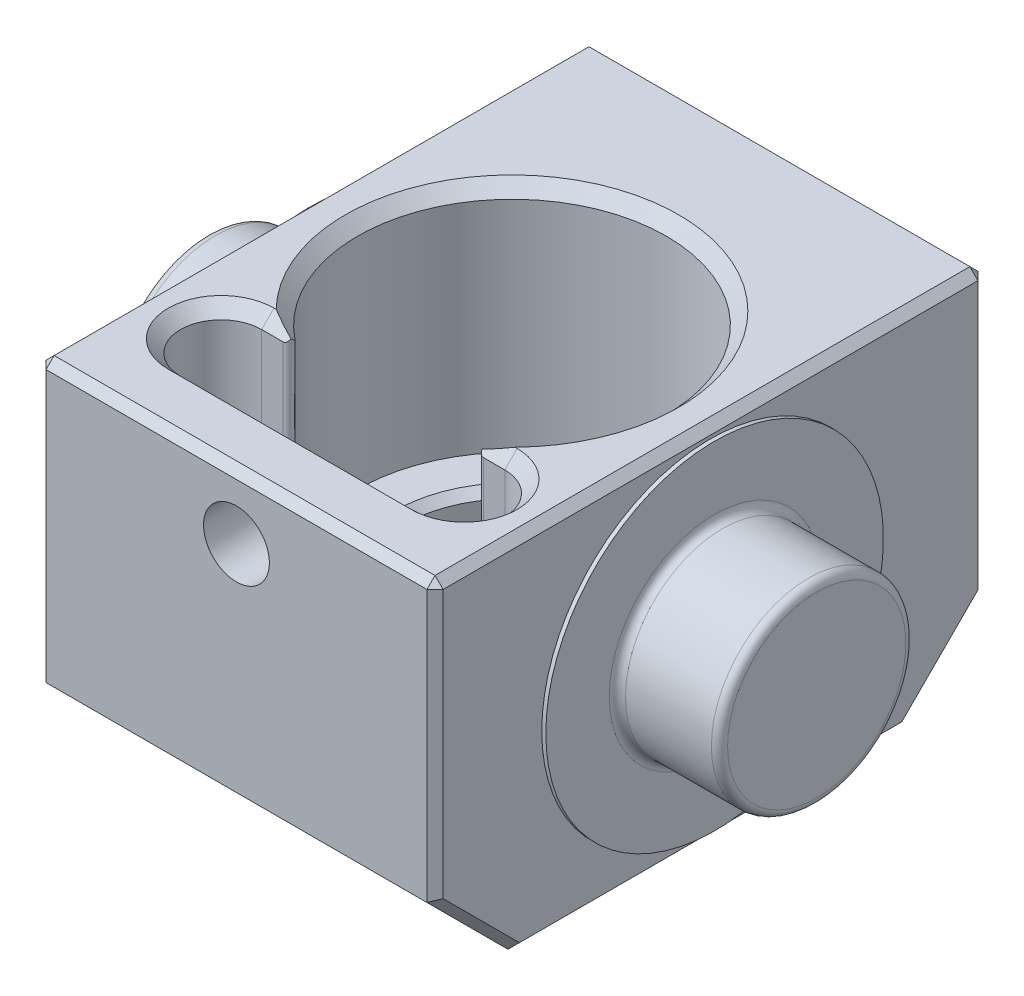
ISO-10303-21;
HEADER;
FILE_DESCRIPTION(('STEP AP214'),'2;1');
FILE_NAME('part.step','',(''),(''),'','','');
FILE_SCHEMA(('AUTOMOTIVE_DESIGN { 1 0 10303 214 1 1 1 1 }'));
ENDSEC;
DATA;
#1=APPLICATION_CONTEXT('core data for automotive mechanical design processes');
#2=APPLICATION_PROTOCOL_DEFINITION('international standard','automotive_design',2000,#1);
#3=PRODUCT_CONTEXT('',#1,'mechanical');
#4=PRODUCT('Part','Part','',(#3));
#5=PRODUCT_RELATED_PRODUCT_CATEGORY('part','',(#4));
#6=PRODUCT_DEFINITION_FORMATION('','',#4);
#7=PRODUCT_DEFINITION_CONTEXT('part definition',#1,'design');
#8=PRODUCT_DEFINITION('design','',#6,#7);
#9=PRODUCT_DEFINITION_SHAPE('','',#8);
#10=(LENGTH_UNIT() NAMED_UNIT(*) SI_UNIT(.MILLI.,.METRE.));
#11=(NAMED_UNIT(*) PLANE_ANGLE_UNIT() SI_UNIT($,.RADIAN.));
#12=(NAMED_UNIT(*) SI_UNIT($,.STERADIAN.) SOLID_ANGLE_UNIT());
#13=UNCERTAINTY_MEASURE_WITH_UNIT(LENGTH_MEASURE(1.E-05),#10,'distance_accuracy_value','');
#14=(GEOMETRIC_REPRESENTATION_CONTEXT(3) GLOBAL_UNCERTAINTY_ASSIGNED_CONTEXT((#13)) GLOBAL_UNIT_ASSIGNED_CONTEXT((#10,
#11,#12)) REPRESENTATION_CONTEXT('',''));
#15=CARTESIAN_POINT('',(0.,0.,0.));
#16=DIRECTION('',(0.,0.,1.));
#17=DIRECTION('',(1.,0.,0.));
#18=AXIS2_PLACEMENT_3D('',#15,#16,#17);
#19=CARTESIAN_POINT('',(-12.25,0.,0.));
#20=DIRECTION('',(1.,0.,0.));
#21=DIRECTION('',(0.,0.,-1.));
#22=AXIS2_PLACEMENT_3D('',#19,#20,#21);
#23=PLANE('',#22);
#24=DIRECTION('',(0.,0.707106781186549,0.707106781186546));
#25=VECTOR('',#24,1.);
#26=CARTESIAN_POINT('',(-12.25,-5.75894660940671,16.6464466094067));
#27=LINE('',#26,#25);
#28=CARTESIAN_POINT('',(-12.25,-10.6125,11.7928932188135));
#29=VERTEX_POINT('',#28);
#30=CARTESIAN_POINT('',(-12.25,-5.90539321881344,16.5));
#31=VERTEX_POINT('',#30);
#32=EDGE_CURVE('E323',#29,#31,#27,.T.);
#33=ORIENTED_EDGE('',*,*,#32,.T.);
#34=DIRECTION('',(0.,1.,0.));
#35=VECTOR('',#34,1.);
#36=CARTESIAN_POINT('',(-12.25,0.,16.5));
#37=LINE('',#36,#35);
#38=CARTESIAN_POINT('',(-12.25,10.6125,16.5));
#39=VERTEX_POINT('',#38);
#40=EDGE_CURVE('E325',#31,#39,#37,.T.);
#41=ORIENTED_EDGE('',*,*,#40,.T.);
#42=DIRECTION('',(0.,0.,-1.));
#43=VECTOR('',#42,1.);
#44=CARTESIAN_POINT('',(-12.25,10.6125,0.));
#45=LINE('',#44,#43);
#46=CARTESIAN_POINT('',(-12.25,10.6125,-16.5));
#47=VERTEX_POINT('',#46);
#48=EDGE_CURVE('E315',#39,#47,#45,.T.);
#49=ORIENTED_EDGE('',*,*,#48,.T.);
#50=DIRECTION('',(0.,-1.,0.));
#51=VECTOR('',#50,1.);
#52=CARTESIAN_POINT('',(-12.25,0.,-16.5));
#53=LINE('',#52,#51);
#54=CARTESIAN_POINT('',(-12.25,-5.90539321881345,-16.5));
#55=VERTEX_POINT('',#54);
#56=EDGE_CURVE('E317',#47,#55,#53,.T.);
#57=ORIENTED_EDGE('',*,*,#56,.T.);
#58=DIRECTION('',(0.,-0.707106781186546,0.707106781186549));
#59=VECTOR('',#58,1.);
#60=CARTESIAN_POINT('',(-12.25,-10.7589466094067,-11.6464466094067));
#61=LINE('',#60,#59);
#62=CARTESIAN_POINT('',(-12.25,-10.6125,-11.7928932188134));
#63=VERTEX_POINT('',#62);
#64=EDGE_CURVE('E319',#55,#63,#61,.T.);
#65=ORIENTED_EDGE('',*,*,#64,.T.);
#66=DIRECTION('',(0.,0.,1.));
#67=VECTOR('',#66,1.);
#68=CARTESIAN_POINT('',(-12.25,-10.6125,0.));
#69=LINE('',#68,#67);
#70=EDGE_CURVE('E321',#63,#29,#69,.T.);
#71=ORIENTED_EDGE('',*,*,#70,.T.);
#72=EDGE_LOOP('',(#33,#41,#49,#57,#65,#71));
#73=FACE_BOUND('',#72,.T.);
#74=CARTESIAN_POINT('',(-12.25,0.,0.));
#75=DIRECTION('',(1.,0.,0.));
#76=DIRECTION('',(0.,0.,-1.));
#77=AXIS2_PLACEMENT_3D('',#74,#75,#76);
#78=CIRCLE('',#77,10.414);
#79=CARTESIAN_POINT('',(-12.25,0.,-10.414));
#80=VERTEX_POINT('',#79);
#81=EDGE_CURVE('E260',#80,#80,#78,.F.);
#82=ORIENTED_EDGE('',*,*,#81,.F.);
#83=EDGE_LOOP('',(#82));
#84=FACE_BOUND('',#83,.T.);
#85=ADVANCED_FACE('F32',(#73,#84),#23,.F.);
#86=CARTESIAN_POINT('',(12.25,0.,0.));
#87=DIRECTION('',(1.,0.,0.));
#88=DIRECTION('',(0.,0.,-1.));
#89=AXIS2_PLACEMENT_3D('',#86,#87,#88);
#90=PLANE('',#89);
#91=DIRECTION('',(0.,-1.,0.));
#92=VECTOR('',#91,1.);
#93=CARTESIAN_POINT('',(12.25,-6.11249999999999,16.5));
#94=LINE('',#93,#92);
#95=CARTESIAN_POINT('',(12.25,10.6125,16.5));
#96=VERTEX_POINT('',#95);
#97=CARTESIAN_POINT('',(12.25,-5.90539321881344,16.5));
#98=VERTEX_POINT('',#97);
#99=EDGE_CURVE('E285',#96,#98,#94,.T.);
#100=ORIENTED_EDGE('',*,*,#99,.T.);
#101=DIRECTION('',(0.,-0.707106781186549,-0.707106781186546));
#102=VECTOR('',#101,1.);
#103=CARTESIAN_POINT('',(12.25,-11.2026966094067,11.2026966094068));
#104=LINE('',#103,#102);
#105=CARTESIAN_POINT('',(12.25,-10.6125,11.7928932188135));
#106=VERTEX_POINT('',#105);
#107=EDGE_CURVE('E287',#98,#106,#104,.T.);
#108=ORIENTED_EDGE('',*,*,#107,.T.);
#109=DIRECTION('',(0.,0.,-1.));
#110=VECTOR('',#109,1.);
#111=CARTESIAN_POINT('',(12.25,-10.6125,-12.));
#112=LINE('',#111,#110);
#113=CARTESIAN_POINT('',(12.25,-10.6125,-11.7928932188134));
#114=VERTEX_POINT('',#113);
#115=EDGE_CURVE('E283',#106,#114,#112,.T.);
#116=ORIENTED_EDGE('',*,*,#115,.T.);
#117=DIRECTION('',(0.,0.707106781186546,-0.707106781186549));
#118=VECTOR('',#117,1.);
#119=CARTESIAN_POINT('',(12.25,-11.2026966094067,-11.2026966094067));
#120=LINE('',#119,#118);
#121=CARTESIAN_POINT('',(12.25,-5.90539321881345,-16.5));
#122=VERTEX_POINT('',#121);
#123=EDGE_CURVE('E281',#114,#122,#120,.T.);
#124=ORIENTED_EDGE('',*,*,#123,.T.);
#125=DIRECTION('',(0.,1.,0.));
#126=VECTOR('',#125,1.);
#127=CARTESIAN_POINT('',(12.25,11.1125,-16.5));
#128=LINE('',#127,#126);
#129=CARTESIAN_POINT('',(12.25,10.6125,-16.5));
#130=VERTEX_POINT('',#129);
#131=EDGE_CURVE('E279',#122,#130,#128,.T.);
#132=ORIENTED_EDGE('',*,*,#131,.T.);
#133=DIRECTION('',(0.,0.,1.));
#134=VECTOR('',#133,1.);
#135=CARTESIAN_POINT('',(12.25,10.6125,17.));
#136=LINE('',#135,#134);
#137=EDGE_CURVE('E277',#130,#96,#136,.T.);
#138=ORIENTED_EDGE('',*,*,#137,.T.);
#139=EDGE_LOOP('',(#100,#108,#116,#124,#132,#138));
#140=FACE_BOUND('',#139,.T.);
#141=CARTESIAN_POINT('',(12.25,0.,0.));
#142=DIRECTION('',(-1.,0.,0.));
#143=DIRECTION('',(0.,0.,1.));
#144=AXIS2_PLACEMENT_3D('',#141,#142,#143);
#145=CIRCLE('',#144,10.414);
#146=CARTESIAN_POINT('',(12.25,0.,10.414));
#147=VERTEX_POINT('',#146);
#148=EDGE_CURVE('E257',#147,#147,#145,.T.);
#149=ORIENTED_EDGE('',*,*,#148,.T.);
#150=EDGE_LOOP('',(#149));
#151=FACE_BOUND('',#150,.T.);
#152=ADVANCED_FACE('F536',(#140,#151),#90,.T.);
#153=CARTESIAN_POINT('',(12.25,11.1125,-17.));
#154=DIRECTION('',(0.,0.,1.));
#155=DIRECTION('',(0.,-1.,0.));
#156=AXIS2_PLACEMENT_3D('',#153,#154,#155);
#157=PLANE('',#156);
#158=DIRECTION('',(1.,0.,0.));
#159=VECTOR('',#158,1.);
#160=CARTESIAN_POINT('',(12.25,10.6125,-17.));
#161=LINE('',#160,#159);
#162=CARTESIAN_POINT('',(-11.75,10.6125,-17.));
#163=VERTEX_POINT('',#162);
#164=CARTESIAN_POINT('',(11.75,10.6125,-17.));
#165=VERTEX_POINT('',#164);
#166=EDGE_CURVE('E309',#163,#165,#161,.T.);
#167=ORIENTED_EDGE('',*,*,#166,.T.);
#168=DIRECTION('',(0.,-1.,0.));
#169=VECTOR('',#168,1.);
#170=CARTESIAN_POINT('',(11.75,-6.1125,-17.));
#171=LINE('',#170,#169);
#172=CARTESIAN_POINT('',(11.75,-6.1125,-17.));
#173=VERTEX_POINT('',#172);
#174=EDGE_CURVE('E313',#165,#173,#171,.T.);
#175=ORIENTED_EDGE('',*,*,#174,.T.);
#176=DIRECTION('',(-1.,0.,0.));
#177=VECTOR('',#176,1.);
#178=CARTESIAN_POINT('',(12.25,-6.1125,-17.));
#179=LINE('',#178,#177);
#180=CARTESIAN_POINT('',(-11.75,-6.1125,-17.));
#181=VERTEX_POINT('',#180);
#182=EDGE_CURVE('E265',#173,#181,#179,.T.);
#183=ORIENTED_EDGE('',*,*,#182,.T.);
#184=DIRECTION('',(0.,1.,0.));
#185=VECTOR('',#184,1.);
#186=CARTESIAN_POINT('',(-11.75,11.1125,-17.));
#187=LINE('',#186,#185);
#188=EDGE_CURVE('E311',#181,#163,#187,.T.);
#189=ORIENTED_EDGE('',*,*,#188,.T.);
#190=EDGE_LOOP('',(#167,#175,#183,#189));
#191=FACE_BOUND('',#190,.T.);
#192=ADVANCED_FACE('F542',(#191),#157,.F.);
#193=CARTESIAN_POINT('',(12.25,11.1125,17.));
#194=DIRECTION('',(0.,-1.,0.));
#195=DIRECTION('',(0.,0.,-1.));
#196=AXIS2_PLACEMENT_3D('',#193,#194,#195);
#197=PLANE('',#196);
#198=CARTESIAN_POINT('',(7.5,11.1125,10.44639));
#199=DIRECTION('',(0.,-1.,0.));
#200=DIRECTION('',(0.,0.,-1.));
#201=AXIS2_PLACEMENT_3D('',#198,#199,#200);
#202=CIRCLE('',#201,3.26200000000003);
#203=CARTESIAN_POINT('',(7.5,11.1125,7.18438999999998));
#204=VERTEX_POINT('',#203);
#205=CARTESIAN_POINT('',(7.5,11.1125,13.70839));
#206=VERTEX_POINT('',#205);
#207=EDGE_CURVE('E402',#204,#206,#202,.T.);
#208=ORIENTED_EDGE('',*,*,#207,.T.);
#209=DIRECTION('',(-1.,0.,0.));
#210=VECTOR('',#209,1.);
#211=CARTESIAN_POINT('',(12.25,11.1125,13.70839));
#212=LINE('',#211,#210);
#213=CARTESIAN_POINT('',(-7.5,11.1125,13.70839));
#214=VERTEX_POINT('',#213);
#215=EDGE_CURVE('E404',#206,#214,#212,.T.);
#216=ORIENTED_EDGE('',*,*,#215,.T.);
#217=CARTESIAN_POINT('',(-7.5,11.1125,10.44639));
#218=DIRECTION('',(0.,-1.,0.));
#219=DIRECTION('',(0.,0.,-1.));
#220=AXIS2_PLACEMENT_3D('',#217,#218,#219);
#221=CIRCLE('',#220,3.26200000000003);
#222=CARTESIAN_POINT('',(-7.5,11.1125,7.18438999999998));
#223=VERTEX_POINT('',#222);
#224=EDGE_CURVE('E393',#214,#223,#221,.T.);
#225=ORIENTED_EDGE('',*,*,#224,.T.);
#226=DIRECTION('',(1.,0.,0.));
#227=VECTOR('',#226,1.);
#228=CARTESIAN_POINT('',(12.25,11.1125,7.18438999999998));
#229=LINE('',#228,#227);
#230=CARTESIAN_POINT('',(-7.3678565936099,11.1125,7.18438999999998));
#231=VERTEX_POINT('',#230);
#232=EDGE_CURVE('E395',#223,#231,#229,.T.);
#233=ORIENTED_EDGE('',*,*,#232,.T.);
#234=CARTESIAN_POINT('',(0.,11.1125,0.));
#235=DIRECTION('',(0.,-1.,0.));
#236=DIRECTION('',(0.,0.,-1.));
#237=AXIS2_PLACEMENT_3D('',#234,#235,#236);
#238=CIRCLE('',#237,10.29081);
#239=CARTESIAN_POINT('',(7.3678565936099,11.1125,7.18438999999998));
#240=VERTEX_POINT('',#239);
#241=EDGE_CURVE('E398',#231,#240,#238,.T.);
#242=ORIENTED_EDGE('',*,*,#241,.T.);
#243=DIRECTION('',(1.,0.,0.));
#244=VECTOR('',#243,1.);
#245=CARTESIAN_POINT('',(12.25,11.1125,7.18438999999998));
#246=LINE('',#245,#244);
#247=EDGE_CURVE('E400',#240,#204,#246,.T.);
#248=ORIENTED_EDGE('',*,*,#247,.T.);
#249=EDGE_LOOP('',(#208,#216,#225,#233,#242,#248));
#250=FACE_BOUND('',#249,.T.);
#251=DIRECTION('',(0.,0.,-1.));
#252=VECTOR('',#251,1.);
#253=CARTESIAN_POINT('',(11.75,11.1125,-17.));
#254=LINE('',#253,#252);
#255=CARTESIAN_POINT('',(11.75,11.1125,16.5));
#256=VERTEX_POINT('',#255);
#257=CARTESIAN_POINT('',(11.75,11.1125,-16.5));
#258=VERTEX_POINT('',#257);
#259=EDGE_CURVE('E332',#256,#258,#254,.T.);
#260=ORIENTED_EDGE('',*,*,#259,.T.);
#261=DIRECTION('',(-1.,0.,0.));
#262=VECTOR('',#261,1.);
#263=CARTESIAN_POINT('',(12.25,11.1125,-16.5));
#264=LINE('',#263,#262);
#265=CARTESIAN_POINT('',(-11.75,11.1125,-16.5));
#266=VERTEX_POINT('',#265);
#267=EDGE_CURVE('E334',#258,#266,#264,.T.);
#268=ORIENTED_EDGE('',*,*,#267,.T.);
#269=DIRECTION('',(0.,0.,1.));
#270=VECTOR('',#269,1.);
#271=CARTESIAN_POINT('',(-11.75,11.1125,17.));
#272=LINE('',#271,#270);
#273=CARTESIAN_POINT('',(-11.75,11.1125,16.5));
#274=VERTEX_POINT('',#273);
#275=EDGE_CURVE('E328',#266,#274,#272,.T.);
#276=ORIENTED_EDGE('',*,*,#275,.T.);
#277=DIRECTION('',(1.,0.,0.));
#278=VECTOR('',#277,1.);
#279=CARTESIAN_POINT('',(12.25,11.1125,16.5));
#280=LINE('',#279,#278);
#281=EDGE_CURVE('E330',#274,#256,#280,.T.);
#282=ORIENTED_EDGE('',*,*,#281,.T.);
#283=EDGE_LOOP('',(#260,#268,#276,#282));
#284=FACE_BOUND('',#283,.T.);
#285=ADVANCED_FACE('F556',(#250,#284),#197,.F.);
#286=CARTESIAN_POINT('',(12.25,11.1125,17.));
#287=DIRECTION('',(0.,0.,-1.));
#288=DIRECTION('',(0.,1.,0.));
#289=AXIS2_PLACEMENT_3D('',#286,#287,#288);
#290=PLANE('',#289);
#291=CARTESIAN_POINT('',(0.,7.1725,17.));
#292=DIRECTION('',(0.,0.,1.));
#293=DIRECTION('',(1.,0.,0.));
#294=AXIS2_PLACEMENT_3D('',#291,#292,#293);
#295=CIRCLE('',#294,2.032);
#296=CARTESIAN_POINT('',(2.032,7.1725,17.));
#297=VERTEX_POINT('',#296);
#298=EDGE_CURVE('E236',#297,#297,#295,.T.);
#299=ORIENTED_EDGE('',*,*,#298,.F.);
#300=EDGE_LOOP('',(#299));
#301=FACE_BOUND('',#300,.T.);
#302=DIRECTION('',(1.,0.,0.));
#303=VECTOR('',#302,1.);
#304=CARTESIAN_POINT('',(12.25,-6.11249999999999,17.));
#305=LINE('',#304,#303);
#306=CARTESIAN_POINT('',(-11.75,-6.11249999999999,17.));
#307=VERTEX_POINT('',#306);
#308=CARTESIAN_POINT('',(11.75,-6.11249999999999,17.));
#309=VERTEX_POINT('',#308);
#310=EDGE_CURVE('E274',#307,#309,#305,.T.);
#311=ORIENTED_EDGE('',*,*,#310,.T.);
#312=DIRECTION('',(0.,1.,0.));
#313=VECTOR('',#312,1.);
#314=CARTESIAN_POINT('',(11.75,11.1125,17.));
#315=LINE('',#314,#313);
#316=CARTESIAN_POINT('',(11.75,10.6125,17.));
#317=VERTEX_POINT('',#316);
#318=EDGE_CURVE('E299',#309,#317,#315,.T.);
#319=ORIENTED_EDGE('',*,*,#318,.T.);
#320=DIRECTION('',(-1.,0.,0.));
#321=VECTOR('',#320,1.);
#322=CARTESIAN_POINT('',(12.25,10.6125,17.));
#323=LINE('',#322,#321);
#324=CARTESIAN_POINT('',(-11.75,10.6125,17.));
#325=VERTEX_POINT('',#324);
#326=EDGE_CURVE('E295',#317,#325,#323,.T.);
#327=ORIENTED_EDGE('',*,*,#326,.T.);
#328=DIRECTION('',(0.,-1.,0.));
#329=VECTOR('',#328,1.);
#330=CARTESIAN_POINT('',(-11.75,11.1125,17.));
#331=LINE('',#330,#329);
#332=EDGE_CURVE('E297',#325,#307,#331,.T.);
#333=ORIENTED_EDGE('',*,*,#332,.T.);
#334=EDGE_LOOP('',(#311,#319,#327,#333));
#335=FACE_BOUND('',#334,.T.);
#336=ADVANCED_FACE('F552',(#301,#335),#290,.F.);
#337=CARTESIAN_POINT('',(12.25,-11.1125,17.));
#338=DIRECTION('',(0.,1.,0.));
#339=DIRECTION('',(0.,0.,1.));
#340=AXIS2_PLACEMENT_3D('',#337,#338,#339);
#341=PLANE('',#340);
#342=CARTESIAN_POINT('',(0.,-11.1125,0.));
#343=DIRECTION('',(0.,1.,0.));
#344=DIRECTION('',(0.,0.,1.));
#345=AXIS2_PLACEMENT_3D('',#342,#343,#344);
#346=CIRCLE('',#345,7.23099999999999);
#347=CARTESIAN_POINT('',(0.,-11.1125,7.23099999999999));
#348=VERTEX_POINT('',#347);
#349=EDGE_CURVE('E496',#348,#348,#346,.T.);
#350=ORIENTED_EDGE('',*,*,#349,.T.);
#351=EDGE_LOOP('',(#350));
#352=FACE_BOUND('',#351,.T.);
#353=DIRECTION('',(1.,0.,0.));
#354=VECTOR('',#353,1.);
#355=CARTESIAN_POINT('',(12.25,-11.1125,-12.));
#356=LINE('',#355,#354);
#357=CARTESIAN_POINT('',(-11.75,-11.1125,-12.));
#358=VERTEX_POINT('',#357);
#359=CARTESIAN_POINT('',(11.75,-11.1125,-12.));
#360=VERTEX_POINT('',#359);
#361=EDGE_CURVE('E271',#358,#360,#356,.T.);
#362=ORIENTED_EDGE('',*,*,#361,.T.);
#363=DIRECTION('',(0.,0.,1.));
#364=VECTOR('',#363,1.);
#365=CARTESIAN_POINT('',(11.75,-11.1125,12.));
#366=LINE('',#365,#364);
#367=CARTESIAN_POINT('',(11.75,-11.1125,12.));
#368=VERTEX_POINT('',#367);
#369=EDGE_CURVE('E303',#360,#368,#366,.T.);
#370=ORIENTED_EDGE('',*,*,#369,.T.);
#371=DIRECTION('',(-1.,0.,0.));
#372=VECTOR('',#371,1.);
#373=CARTESIAN_POINT('',(12.25,-11.1125,12.));
#374=LINE('',#373,#372);
#375=CARTESIAN_POINT('',(-11.75,-11.1125,12.));
#376=VERTEX_POINT('',#375);
#377=EDGE_CURVE('E268',#368,#376,#374,.T.);
#378=ORIENTED_EDGE('',*,*,#377,.T.);
#379=DIRECTION('',(0.,0.,-1.));
#380=VECTOR('',#379,1.);
#381=CARTESIAN_POINT('',(-11.75,-11.1125,17.));
#382=LINE('',#381,#380);
#383=EDGE_CURVE('E301',#376,#358,#382,.T.);
#384=ORIENTED_EDGE('',*,*,#383,.T.);
#385=EDGE_LOOP('',(#362,#370,#378,#384));
#386=FACE_BOUND('',#385,.T.);
#387=ADVANCED_FACE('F548',(#352,#386),#341,.F.);
#388=CARTESIAN_POINT('',(0.,0.,0.));
#389=DIRECTION('',(-1.,0.,0.));
#390=DIRECTION('',(0.,0.,1.));
#391=AXIS2_PLACEMENT_3D('',#388,#389,#390);
#392=CYLINDRICAL_SURFACE('',#391,10.414);
#393=ORIENTED_EDGE('',*,*,#148,.F.);
#394=EDGE_LOOP('',(#393));
#395=FACE_BOUND('',#394,.T.);
#396=CARTESIAN_POINT('',(12.5,0.,0.));
#397=DIRECTION('',(-1.,0.,0.));
#398=DIRECTION('',(0.,0.,1.));
#399=AXIS2_PLACEMENT_3D('',#396,#397,#398);
#400=CIRCLE('',#399,10.414);
#401=CARTESIAN_POINT('',(12.5,0.,10.414));
#402=VERTEX_POINT('',#401);
#403=EDGE_CURVE('E254',#402,#402,#400,.T.);
#404=ORIENTED_EDGE('',*,*,#403,.T.);
#405=EDGE_LOOP('',(#404));
#406=FACE_BOUND('',#405,.T.);
#407=ADVANCED_FACE('F551',(#395,#406),#392,.T.);
#408=CARTESIAN_POINT('',(12.5,10.414,0.));
#409=DIRECTION('',(-1.,0.,0.));
#410=DIRECTION('',(0.,0.,1.));
#411=AXIS2_PLACEMENT_3D('',#408,#409,#410);
#412=PLANE('',#411);
#413=CARTESIAN_POINT('',(12.5,0.,0.));
#414=DIRECTION('',(-1.,0.,0.));
#415=DIRECTION('',(0.,0.,1.));
#416=AXIS2_PLACEMENT_3D('',#413,#414,#415);
#417=CIRCLE('',#416,6.500000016);
#418=CARTESIAN_POINT('',(12.5,0.,6.500000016));
#419=VERTEX_POINT('',#418);
#420=EDGE_CURVE('E511',#419,#419,#417,.T.);
#421=ORIENTED_EDGE('',*,*,#420,.T.);
#422=EDGE_LOOP('',(#421));
#423=FACE_BOUND('',#422,.T.);
#424=ORIENTED_EDGE('',*,*,#403,.F.);
#425=EDGE_LOOP('',(#424));
#426=FACE_BOUND('',#425,.T.);
#427=ADVANCED_FACE('F724',(#423,#426),#412,.F.);
#428=CARTESIAN_POINT('',(0.,0.,0.));
#429=DIRECTION('',(-1.,0.,0.));
#430=DIRECTION('',(0.,0.,1.));
#431=AXIS2_PLACEMENT_3D('',#428,#429,#430);
#432=CYLINDRICAL_SURFACE('',#431,6.);
#433=CARTESIAN_POINT('',(13.000000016,0.,0.));
#434=DIRECTION('',(-1.,0.,0.));
#435=DIRECTION('',(0.,0.,1.));
#436=AXIS2_PLACEMENT_3D('',#433,#434,#435);
#437=CIRCLE('',#436,6.);
#438=CARTESIAN_POINT('',(13.000000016,0.,6.));
#439=VERTEX_POINT('',#438);
#440=EDGE_CURVE('E514',#439,#439,#437,.F.);
#441=ORIENTED_EDGE('',*,*,#440,.T.);
#442=EDGE_LOOP('',(#441));
#443=FACE_BOUND('',#442,.T.);
#444=CARTESIAN_POINT('',(18.299999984,0.,0.));
#445=DIRECTION('',(-1.,0.,0.));
#446=DIRECTION('',(0.,0.,1.));
#447=AXIS2_PLACEMENT_3D('',#444,#445,#446);
#448=CIRCLE('',#447,6.);
#449=CARTESIAN_POINT('',(18.299999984,0.,6.));
#450=VERTEX_POINT('',#449);
#451=EDGE_CURVE('E505',#450,#450,#448,.T.);
#452=ORIENTED_EDGE('',*,*,#451,.T.);
#453=EDGE_LOOP('',(#452));
#454=FACE_BOUND('',#453,.T.);
#455=ADVANCED_FACE('F720',(#443,#454),#432,.T.);
#456=CARTESIAN_POINT('',(18.8,6.,0.));
#457=DIRECTION('',(-1.,0.,0.));
#458=DIRECTION('',(0.,0.,1.));
#459=AXIS2_PLACEMENT_3D('',#456,#457,#458);
#460=PLANE('',#459);
#461=CARTESIAN_POINT('',(18.8,0.,0.));
#462=DIRECTION('',(-1.,0.,0.));
#463=DIRECTION('',(0.,0.,1.));
#464=AXIS2_PLACEMENT_3D('',#461,#462,#463);
#465=CIRCLE('',#464,5.499999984);
#466=CARTESIAN_POINT('',(18.8,0.,5.499999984));
#467=VERTEX_POINT('',#466);
#468=EDGE_CURVE('E508',#467,#467,#465,.F.);
#469=ORIENTED_EDGE('',*,*,#468,.T.);
#470=EDGE_LOOP('',(#469));
#471=FACE_BOUND('',#470,.T.);
#472=ADVANCED_FACE('F716',(#471),#460,.F.);
#473=CARTESIAN_POINT('',(0.,0.,0.));
#474=DIRECTION('',(1.,0.,0.));
#475=DIRECTION('',(0.,0.,1.));
#476=AXIS2_PLACEMENT_3D('',#473,#474,#475);
#477=CYLINDRICAL_SURFACE('',#476,10.414);
#478=ORIENTED_EDGE('',*,*,#81,.T.);
#479=EDGE_LOOP('',(#478));
#480=FACE_BOUND('',#479,.T.);
#481=CARTESIAN_POINT('',(-12.5,0.,0.));
#482=DIRECTION('',(-1.,0.,0.));
#483=DIRECTION('',(0.,0.,1.));
#484=AXIS2_PLACEMENT_3D('',#481,#482,#483);
#485=CIRCLE('',#484,10.414);
#486=CARTESIAN_POINT('',(-12.5,0.,10.414));
#487=VERTEX_POINT('',#486);
#488=EDGE_CURVE('E251',#487,#487,#485,.T.);
#489=ORIENTED_EDGE('',*,*,#488,.F.);
#490=EDGE_LOOP('',(#489));
#491=FACE_BOUND('',#490,.T.);
#492=ADVANCED_FACE('F712',(#480,#491),#477,.T.);
#493=CARTESIAN_POINT('',(-12.5,10.414,0.));
#494=DIRECTION('',(1.,0.,0.));
#495=DIRECTION('',(0.,0.,1.));
#496=AXIS2_PLACEMENT_3D('',#493,#494,#495);
#497=PLANE('',#496);
#498=CARTESIAN_POINT('',(-12.5,0.,0.));
#499=DIRECTION('',(1.,0.,0.));
#500=DIRECTION('',(0.,0.,-1.));
#501=AXIS2_PLACEMENT_3D('',#498,#499,#500);
#502=CIRCLE('',#501,6.500000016);
#503=CARTESIAN_POINT('',(-12.5,0.,-6.500000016));
#504=VERTEX_POINT('',#503);
#505=EDGE_CURVE('E11',#504,#504,#502,.T.);
#506=ORIENTED_EDGE('',*,*,#505,.T.);
#507=EDGE_LOOP('',(#506));
#508=FACE_BOUND('',#507,.T.);
#509=ORIENTED_EDGE('',*,*,#488,.T.);
#510=EDGE_LOOP('',(#509));
#511=FACE_BOUND('',#510,.T.);
#512=ADVANCED_FACE('F709',(#508,#511),#497,.F.);
#513=CARTESIAN_POINT('',(0.,0.,0.));
#514=DIRECTION('',(1.,0.,0.));
#515=DIRECTION('',(0.,0.,1.));
#516=AXIS2_PLACEMENT_3D('',#513,#514,#515);
#517=CYLINDRICAL_SURFACE('',#516,6.);
#518=CARTESIAN_POINT('',(-13.000000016,0.,0.));
#519=DIRECTION('',(1.,0.,0.));
#520=DIRECTION('',(0.,0.,-1.));
#521=AXIS2_PLACEMENT_3D('',#518,#519,#520);
#522=CIRCLE('',#521,6.);
#523=CARTESIAN_POINT('',(-13.000000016,0.,-6.));
#524=VERTEX_POINT('',#523);
#525=EDGE_CURVE('E40',#524,#524,#522,.F.);
#526=ORIENTED_EDGE('',*,*,#525,.T.);
#527=EDGE_LOOP('',(#526));
#528=FACE_BOUND('',#527,.T.);
#529=CARTESIAN_POINT('',(-18.299999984,0.,0.));
#530=DIRECTION('',(1.,0.,0.));
#531=DIRECTION('',(0.,0.,-1.));
#532=AXIS2_PLACEMENT_3D('',#529,#530,#531);
#533=CIRCLE('',#532,6.);
#534=CARTESIAN_POINT('',(-18.299999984,0.,-6.));
#535=VERTEX_POINT('',#534);
#536=EDGE_CURVE('E502',#535,#535,#533,.T.);
#537=ORIENTED_EDGE('',*,*,#536,.T.);
#538=EDGE_LOOP('',(#537));
#539=FACE_BOUND('',#538,.T.);
#540=ADVANCED_FACE('F519',(#528,#539),#517,.T.);
#541=CARTESIAN_POINT('',(-18.8,6.,0.));
#542=DIRECTION('',(1.,0.,0.));
#543=DIRECTION('',(0.,0.,1.));
#544=AXIS2_PLACEMENT_3D('',#541,#542,#543);
#545=PLANE('',#544);
#546=CARTESIAN_POINT('',(-18.8,0.,0.));
#547=DIRECTION('',(1.,0.,0.));
#548=DIRECTION('',(0.,0.,-1.));
#549=AXIS2_PLACEMENT_3D('',#546,#547,#548);
#550=CIRCLE('',#549,5.499999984);
#551=CARTESIAN_POINT('',(-18.8,0.,-5.499999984));
#552=VERTEX_POINT('',#551);
#553=EDGE_CURVE('E499',#552,#552,#550,.F.);
#554=ORIENTED_EDGE('',*,*,#553,.T.);
#555=EDGE_LOOP('',(#554));
#556=FACE_BOUND('',#555,.T.);
#557=ADVANCED_FACE('F697',(#556),#545,.F.);
#558=CARTESIAN_POINT('',(0.,-3.175,0.));
#559=DIRECTION('',(0.,-1.,0.));
#560=DIRECTION('',(0.,0.,-1.));
#561=AXIS2_PLACEMENT_3D('',#558,#559,#560);
#562=PLANE('',#561);
#563=CARTESIAN_POINT('',(0.,-3.175,0.));
#564=DIRECTION('',(0.,-1.,0.));
#565=DIRECTION('',(0.,0.,-1.));
#566=AXIS2_PLACEMENT_3D('',#563,#564,#565);
#567=CIRCLE('',#566,7.23099999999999);
#568=CARTESIAN_POINT('',(0.,-3.175,-7.23099999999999));
#569=VERTEX_POINT('',#568);
#570=EDGE_CURVE('E493',#569,#569,#567,.T.);
#571=ORIENTED_EDGE('',*,*,#570,.T.);
#572=EDGE_LOOP('',(#571));
#573=FACE_BOUND('',#572,.T.);
#574=CARTESIAN_POINT('',(0.,-3.175,0.));
#575=DIRECTION('',(0.,1.,0.));
#576=DIRECTION('',(0.,0.,1.));
#577=AXIS2_PLACEMENT_3D('',#574,#575,#576);
#578=CIRCLE('',#577,9.52881);
#579=CARTESIAN_POINT('',(0.,-3.175,9.52881));
#580=VERTEX_POINT('',#579);
#581=EDGE_CURVE('E244',#580,#580,#578,.T.);
#582=ORIENTED_EDGE('',*,*,#581,.T.);
#583=EDGE_LOOP('',(#582));
#584=FACE_BOUND('',#583,.T.);
#585=ADVANCED_FACE('F692',(#573,#584),#562,.F.);
#586=CARTESIAN_POINT('',(0.,10.1246822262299,0.));
#587=DIRECTION('',(0.,1.,0.));
#588=DIRECTION('',(0.,0.,1.));
#589=AXIS2_PLACEMENT_3D('',#586,#587,#588);
#590=CYLINDRICAL_SURFACE('',#589,9.52880999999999);
#591=CARTESIAN_POINT('',(0.,4.6125,0.));
#592=DIRECTION('',(0.,1.,0.));
#593=DIRECTION('',(0.,0.,1.));
#594=AXIS2_PLACEMENT_3D('',#591,#592,#593);
#595=CIRCLE('',#594,9.52880999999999);
#596=CARTESIAN_POINT('',(5.98712011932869,4.6125,7.41300294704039));
#597=VERTEX_POINT('',#596);
#598=CARTESIAN_POINT('',(-5.98712011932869,4.6125,7.41300294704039));
#599=VERTEX_POINT('',#598);
#600=EDGE_CURVE('E263',#597,#599,#595,.F.);
#601=ORIENTED_EDGE('',*,*,#600,.F.);
#602=DIRECTION('',(0.,1.,0.));
#603=VECTOR('',#602,1.);
#604=CARTESIAN_POINT('',(5.98712011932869,10.1246822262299,7.41300294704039));
#605=LINE('',#604,#603);
#606=CARTESIAN_POINT('',(5.98712011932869,10.3505,7.41300294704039));
#607=VERTEX_POINT('',#606);
#608=EDGE_CURVE('E683',#597,#607,#605,.T.);
#609=ORIENTED_EDGE('',*,*,#608,.T.);
#610=CARTESIAN_POINT('',(0.,10.3505,0.));
#611=DIRECTION('',(0.,-1.,0.));
#612=DIRECTION('',(0.,0.,-1.));
#613=AXIS2_PLACEMENT_3D('',#610,#611,#612);
#614=CIRCLE('',#613,9.52880999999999);
#615=CARTESIAN_POINT('',(-5.98712011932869,10.3505,7.41300294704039));
#616=VERTEX_POINT('',#615);
#617=EDGE_CURVE('E412',#607,#616,#614,.F.);
#618=ORIENTED_EDGE('',*,*,#617,.T.);
#619=DIRECTION('',(0.,1.,0.));
#620=VECTOR('',#619,1.);
#621=CARTESIAN_POINT('',(-5.98712011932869,10.1246822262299,7.41300294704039));
#622=LINE('',#621,#620);
#623=EDGE_CURVE('E418',#616,#599,#622,.F.);
#624=ORIENTED_EDGE('',*,*,#623,.T.);
#625=EDGE_LOOP('',(#601,#609,#618,#624));
#626=FACE_BOUND('',#625,.T.);
#627=ORIENTED_EDGE('',*,*,#581,.F.);
#628=EDGE_LOOP('',(#627));
#629=FACE_BOUND('',#628,.T.);
#630=ADVANCED_FACE('F688',(#626,#629),#590,.F.);
#631=CARTESIAN_POINT('',(0.,-1.92521317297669,0.));
#632=DIRECTION('',(0.,1.,0.));
#633=DIRECTION('',(0.,0.,1.));
#634=AXIS2_PLACEMENT_3D('',#631,#632,#633);
#635=CYLINDRICAL_SURFACE('',#634,6.731);
#636=CARTESIAN_POINT('',(0.,-3.675,0.));
#637=DIRECTION('',(0.,-1.,0.));
#638=DIRECTION('',(0.,0.,-1.));
#639=AXIS2_PLACEMENT_3D('',#636,#637,#638);
#640=CIRCLE('',#639,6.731);
#641=CARTESIAN_POINT('',(0.,-3.675,-6.731));
#642=VERTEX_POINT('',#641);
#643=EDGE_CURVE('E490',#642,#642,#640,.F.);
#644=ORIENTED_EDGE('',*,*,#643,.T.);
#645=EDGE_LOOP('',(#644));
#646=FACE_BOUND('',#645,.T.);
#647=CARTESIAN_POINT('',(0.,-10.6125,0.));
#648=DIRECTION('',(0.,1.,0.));
#649=DIRECTION('',(0.,0.,1.));
#650=AXIS2_PLACEMENT_3D('',#647,#648,#649);
#651=CIRCLE('',#650,6.731);
#652=CARTESIAN_POINT('',(0.,-10.6125,6.731));
#653=VERTEX_POINT('',#652);
#654=EDGE_CURVE('E487',#653,#653,#651,.F.);
#655=ORIENTED_EDGE('',*,*,#654,.T.);
#656=EDGE_LOOP('',(#655));
#657=FACE_BOUND('',#656,.T.);
#658=ADVANCED_FACE('F691',(#646,#657),#635,.F.);
#659=CARTESIAN_POINT('',(-7.5,4.6125,7.94639));
#660=DIRECTION('',(0.,0.,-1.));
#661=DIRECTION('',(-1.,0.,0.));
#662=AXIS2_PLACEMENT_3D('',#659,#660,#661);
#663=PLANE('',#662);
#664=DIRECTION('',(-1.,0.,0.));
#665=VECTOR('',#664,1.);
#666=CARTESIAN_POINT('',(-7.5,4.6125,7.94639));
#667=LINE('',#666,#665);
#668=CARTESIAN_POINT('',(-6.17561543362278,4.6125,7.94639));
#669=VERTEX_POINT('',#668);
#670=CARTESIAN_POINT('',(-7.5,4.6125,7.94639));
#671=VERTEX_POINT('',#670);
#672=EDGE_CURVE('E228',#669,#671,#667,.T.);
#673=ORIENTED_EDGE('',*,*,#672,.F.);
#674=DIRECTION('',(0.,1.,0.));
#675=VECTOR('',#674,1.);
#676=CARTESIAN_POINT('',(-6.17561543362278,4.6125,7.94639));
#677=LINE('',#676,#675);
#678=CARTESIAN_POINT('',(-6.17561543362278,10.3505,7.94639));
#679=VERTEX_POINT('',#678);
#680=EDGE_CURVE('E54',#669,#679,#677,.T.);
#681=ORIENTED_EDGE('',*,*,#680,.T.);
#682=DIRECTION('',(-1.,0.,0.));
#683=VECTOR('',#682,1.);
#684=CARTESIAN_POINT('',(-7.5,10.3505,7.94639));
#685=LINE('',#684,#683);
#686=CARTESIAN_POINT('',(-7.5,10.3505,7.94639));
#687=VERTEX_POINT('',#686);
#688=EDGE_CURVE('E415',#679,#687,#685,.T.);
#689=ORIENTED_EDGE('',*,*,#688,.T.);
#690=DIRECTION('',(0.,1.,0.));
#691=VECTOR('',#690,1.);
#692=CARTESIAN_POINT('',(-7.5,4.6125,7.94639));
#693=LINE('',#692,#691);
#694=EDGE_CURVE('E242',#671,#687,#693,.T.);
#695=ORIENTED_EDGE('',*,*,#694,.F.);
#696=EDGE_LOOP('',(#673,#681,#689,#695));
#697=FACE_BOUND('',#696,.T.);
#698=ADVANCED_FACE('F962',(#697),#663,.F.);
#699=DIRECTION('',(-1.,0.,0.));
#700=VECTOR('',#699,1.);
#701=CARTESIAN_POINT('',(-7.5,10.3505,7.94639));
#702=LINE('',#701,#700);
#703=CARTESIAN_POINT('',(7.5,10.3505,7.94639));
#704=VERTEX_POINT('',#703);
#705=CARTESIAN_POINT('',(6.17561543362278,10.3505,7.94639));
#706=VERTEX_POINT('',#705);
#707=EDGE_CURVE('E409',#704,#706,#702,.T.);
#708=ORIENTED_EDGE('',*,*,#707,.T.);
#709=DIRECTION('',(0.,1.,0.));
#710=VECTOR('',#709,1.);
#711=CARTESIAN_POINT('',(6.17561543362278,4.6125,7.94639));
#712=LINE('',#711,#710);
#713=CARTESIAN_POINT('',(6.17561543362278,4.6125,7.94639));
#714=VERTEX_POINT('',#713);
#715=EDGE_CURVE('E478',#706,#714,#712,.F.);
#716=ORIENTED_EDGE('',*,*,#715,.T.);
#717=CARTESIAN_POINT('',(7.5,4.6125,7.94639));
#718=VERTEX_POINT('',#717);
#719=EDGE_CURVE('E217',#718,#714,#667,.T.);
#720=ORIENTED_EDGE('',*,*,#719,.F.);
#721=DIRECTION('',(0.,1.,0.));
#722=VECTOR('',#721,1.);
#723=CARTESIAN_POINT('',(7.5,4.6125,7.94639));
#724=LINE('',#723,#722);
#725=EDGE_CURVE('E245',#718,#704,#724,.T.);
#726=ORIENTED_EDGE('',*,*,#725,.T.);
#727=EDGE_LOOP('',(#708,#716,#720,#726));
#728=FACE_BOUND('',#727,.T.);
#729=ADVANCED_FACE('F679',(#728),#663,.F.);
#730=CARTESIAN_POINT('',(-7.5,4.6125,10.44639));
#731=DIRECTION('',(0.,1.,0.));
#732=DIRECTION('',(0.,0.,1.));
#733=AXIS2_PLACEMENT_3D('',#730,#731,#732);
#734=PLANE('',#733);
#735=ORIENTED_EDGE('',*,*,#600,.T.);
#736=CARTESIAN_POINT('',(-6.17561543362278,4.6125,7.64639));
#737=DIRECTION('',(0.,1.,0.));
#738=DIRECTION('',(0.,0.,1.));
#739=AXIS2_PLACEMENT_3D('',#736,#737,#738);
#740=CIRCLE('',#739,0.3);
#741=EDGE_CURVE('E47',#599,#669,#740,.F.);
#742=ORIENTED_EDGE('',*,*,#741,.T.);
#743=ORIENTED_EDGE('',*,*,#672,.T.);
#744=CARTESIAN_POINT('',(-7.5,4.6125,10.44639));
#745=DIRECTION('',(0.,1.,0.));
#746=DIRECTION('',(0.,0.,1.));
#747=AXIS2_PLACEMENT_3D('',#744,#745,#746);
#748=CIRCLE('',#747,2.5);
#749=CARTESIAN_POINT('',(-7.5,4.6125,12.94639));
#750=VERTEX_POINT('',#749);
#751=EDGE_CURVE('E210',#671,#750,#748,.T.);
#752=ORIENTED_EDGE('',*,*,#751,.T.);
#753=DIRECTION('',(1.,0.,0.));
#754=VECTOR('',#753,1.);
#755=CARTESIAN_POINT('',(-7.5,4.6125,12.94639));
#756=LINE('',#755,#754);
#757=CARTESIAN_POINT('',(7.5,4.6125,12.94639));
#758=VERTEX_POINT('',#757);
#759=EDGE_CURVE('E220',#750,#758,#756,.T.);
#760=ORIENTED_EDGE('',*,*,#759,.T.);
#761=CARTESIAN_POINT('',(7.5,4.6125,10.44639));
#762=DIRECTION('',(0.,1.,0.));
#763=DIRECTION('',(0.,0.,1.));
#764=AXIS2_PLACEMENT_3D('',#761,#762,#763);
#765=CIRCLE('',#764,2.5);
#766=EDGE_CURVE('E225',#758,#718,#765,.T.);
#767=ORIENTED_EDGE('',*,*,#766,.T.);
#768=ORIENTED_EDGE('',*,*,#719,.T.);
#769=CARTESIAN_POINT('',(6.17561543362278,4.6125,7.64639));
#770=DIRECTION('',(0.,1.,0.));
#771=DIRECTION('',(0.,0.,1.));
#772=AXIS2_PLACEMENT_3D('',#769,#770,#771);
#773=CIRCLE('',#772,0.3);
#774=EDGE_CURVE('E483',#714,#597,#773,.F.);
#775=ORIENTED_EDGE('',*,*,#774,.T.);
#776=EDGE_LOOP('',(#735,#742,#743,#752,#760,#767,#768,#775));
#777=FACE_BOUND('',#776,.T.);
#778=ADVANCED_FACE('F227',(#777),#734,.T.);
#779=CARTESIAN_POINT('',(-7.5,4.6125,10.44639));
#780=DIRECTION('',(0.,1.,0.));
#781=DIRECTION('',(0.,0.,1.));
#782=AXIS2_PLACEMENT_3D('',#779,#780,#781);
#783=CYLINDRICAL_SURFACE('',#782,2.5);
#784=ORIENTED_EDGE('',*,*,#694,.T.);
#785=CARTESIAN_POINT('',(-7.5,10.3505,10.44639));
#786=DIRECTION('',(0.,-1.,0.));
#787=DIRECTION('',(0.,0.,-1.));
#788=AXIS2_PLACEMENT_3D('',#785,#786,#787);
#789=CIRCLE('',#788,2.5);
#790=CARTESIAN_POINT('',(-7.5,10.3505,12.94639));
#791=VERTEX_POINT('',#790);
#792=EDGE_CURVE('E212',#687,#791,#789,.F.);
#793=ORIENTED_EDGE('',*,*,#792,.T.);
#794=DIRECTION('',(0.,1.,0.));
#795=VECTOR('',#794,1.);
#796=CARTESIAN_POINT('',(-7.5,4.6125,12.94639));
#797=LINE('',#796,#795);
#798=EDGE_CURVE('E205',#750,#791,#797,.T.);
#799=ORIENTED_EDGE('',*,*,#798,.F.);
#800=ORIENTED_EDGE('',*,*,#751,.F.);
#801=EDGE_LOOP('',(#784,#793,#799,#800));
#802=FACE_BOUND('',#801,.T.);
#803=ADVANCED_FACE('F208',(#802),#783,.F.);
#804=CARTESIAN_POINT('',(7.5,4.6125,10.44639));
#805=DIRECTION('',(0.,1.,0.));
#806=DIRECTION('',(0.,0.,1.));
#807=AXIS2_PLACEMENT_3D('',#804,#805,#806);
#808=CYLINDRICAL_SURFACE('',#807,2.5);
#809=DIRECTION('',(0.,1.,0.));
#810=VECTOR('',#809,1.);
#811=CARTESIAN_POINT('',(7.5,4.6125,12.94639));
#812=LINE('',#811,#810);
#813=CARTESIAN_POINT('',(7.5,10.3505,12.94639));
#814=VERTEX_POINT('',#813);
#815=EDGE_CURVE('E216',#758,#814,#812,.T.);
#816=ORIENTED_EDGE('',*,*,#815,.T.);
#817=CARTESIAN_POINT('',(7.5,10.3505,10.44639));
#818=DIRECTION('',(0.,-1.,0.));
#819=DIRECTION('',(0.,0.,-1.));
#820=AXIS2_PLACEMENT_3D('',#817,#818,#819);
#821=CIRCLE('',#820,2.5);
#822=EDGE_CURVE('E407',#814,#704,#821,.F.);
#823=ORIENTED_EDGE('',*,*,#822,.T.);
#824=ORIENTED_EDGE('',*,*,#725,.F.);
#825=ORIENTED_EDGE('',*,*,#766,.F.);
#826=EDGE_LOOP('',(#816,#823,#824,#825));
#827=FACE_BOUND('',#826,.T.);
#828=ADVANCED_FACE('F675',(#827),#808,.F.);
#829=CARTESIAN_POINT('',(-7.5,4.6125,12.94639));
#830=DIRECTION('',(0.,0.,1.));
#831=DIRECTION('',(1.,0.,0.));
#832=AXIS2_PLACEMENT_3D('',#829,#830,#831);
#833=PLANE('',#832);
#834=CARTESIAN_POINT('',(0.,7.1725,12.94639));
#835=DIRECTION('',(0.,0.,1.));
#836=DIRECTION('',(1.,0.,0.));
#837=AXIS2_PLACEMENT_3D('',#834,#835,#836);
#838=CIRCLE('',#837,2.032);
#839=CARTESIAN_POINT('',(2.032,7.1725,12.94639));
#840=VERTEX_POINT('',#839);
#841=EDGE_CURVE('E1168',#840,#840,#838,.F.);
#842=ORIENTED_EDGE('',*,*,#841,.F.);
#843=EDGE_LOOP('',(#842));
#844=FACE_BOUND('',#843,.T.);
#845=ORIENTED_EDGE('',*,*,#798,.T.);
#846=DIRECTION('',(1.,0.,0.));
#847=VECTOR('',#846,1.);
#848=CARTESIAN_POINT('',(-7.5,10.3505,12.94639));
#849=LINE('',#848,#847);
#850=EDGE_CURVE('E337',#791,#814,#849,.T.);
#851=ORIENTED_EDGE('',*,*,#850,.T.);
#852=ORIENTED_EDGE('',*,*,#815,.F.);
#853=ORIENTED_EDGE('',*,*,#759,.F.);
#854=EDGE_LOOP('',(#845,#851,#852,#853));
#855=FACE_BOUND('',#854,.T.);
#856=ADVANCED_FACE('F221',(#844,#855),#833,.F.);
#857=CARTESIAN_POINT('',(12.25,-6.1125,-17.));
#858=DIRECTION('',(0.,0.707106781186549,0.707106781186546));
#859=DIRECTION('',(-1.,0.,0.));
#860=AXIS2_PLACEMENT_3D('',#857,#858,#859);
#861=PLANE('',#860);
#862=ORIENTED_EDGE('',*,*,#182,.F.);
#863=DIRECTION('',(0.,0.707106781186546,-0.707106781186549));
#864=VECTOR('',#863,1.);
#865=CARTESIAN_POINT('',(11.75,-6.1125,-17.));
#866=LINE('',#865,#864);
#867=EDGE_CURVE('E307',#173,#360,#866,.F.);
#868=ORIENTED_EDGE('',*,*,#867,.T.);
#869=ORIENTED_EDGE('',*,*,#361,.F.);
#870=DIRECTION('',(0.,-0.707106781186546,0.707106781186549));
#871=VECTOR('',#870,1.);
#872=CARTESIAN_POINT('',(-11.75,-6.1125,-17.));
#873=LINE('',#872,#871);
#874=EDGE_CURVE('E305',#358,#181,#873,.F.);
#875=ORIENTED_EDGE('',*,*,#874,.T.);
#876=EDGE_LOOP('',(#862,#868,#869,#875));
#877=FACE_BOUND('',#876,.T.);
#878=ADVANCED_FACE('F564',(#877),#861,.F.);
#879=CARTESIAN_POINT('',(12.25,-11.1125,12.));
#880=DIRECTION('',(0.,0.707106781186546,-0.707106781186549));
#881=DIRECTION('',(-1.,0.,0.));
#882=AXIS2_PLACEMENT_3D('',#879,#880,#881);
#883=PLANE('',#882);
#884=ORIENTED_EDGE('',*,*,#377,.F.);
#885=DIRECTION('',(0.,-0.707106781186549,-0.707106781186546));
#886=VECTOR('',#885,1.);
#887=CARTESIAN_POINT('',(11.75,-11.1125,12.));
#888=LINE('',#887,#886);
#889=EDGE_CURVE('E292',#368,#309,#888,.F.);
#890=ORIENTED_EDGE('',*,*,#889,.T.);
#891=ORIENTED_EDGE('',*,*,#310,.F.);
#892=DIRECTION('',(0.,0.707106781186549,0.707106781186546));
#893=VECTOR('',#892,1.);
#894=CARTESIAN_POINT('',(-11.75,-11.1125,12.));
#895=LINE('',#894,#893);
#896=EDGE_CURVE('E290',#307,#376,#895,.F.);
#897=ORIENTED_EDGE('',*,*,#896,.T.);
#898=EDGE_LOOP('',(#884,#890,#891,#897));
#899=FACE_BOUND('',#898,.T.);
#900=ADVANCED_FACE('F567',(#899),#883,.F.);
#901=CARTESIAN_POINT('',(-12.25,-11.2026966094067,-11.2026966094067));
#902=DIRECTION('',(0.707106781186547,0.500000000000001,0.499999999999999));
#903=DIRECTION('',(0.,-0.707106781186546,0.707106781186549));
#904=AXIS2_PLACEMENT_3D('',#901,#902,#903);
#905=PLANE('',#904);
#906=DIRECTION('',(-0.678598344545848,0.281084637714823,0.678598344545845));
#907=VECTOR('',#906,1.);
#908=CARTESIAN_POINT('',(-15.0355579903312,-4.75157732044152,-13.7144420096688));
#909=LINE('',#908,#907);
#910=EDGE_CURVE('E233',#181,#55,#909,.T.);
#911=ORIENTED_EDGE('',*,*,#910,.F.);
#912=ORIENTED_EDGE('',*,*,#874,.F.);
#913=DIRECTION('',(-0.678598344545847,0.678598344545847,0.281084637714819));
#914=VECTOR('',#913,1.);
#915=CARTESIAN_POINT('',(-12.0907931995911,-10.7717068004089,-11.8588388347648));
#916=LINE('',#915,#914);
#917=EDGE_CURVE('E230',#63,#358,#916,.F.);
#918=ORIENTED_EDGE('',*,*,#917,.F.);
#919=ORIENTED_EDGE('',*,*,#64,.F.);
#920=EDGE_LOOP('',(#911,#912,#918,#919));
#921=FACE_BOUND('',#920,.T.);
#922=ADVANCED_FACE('F571',(#921),#905,.F.);
#923=CARTESIAN_POINT('',(-11.75,-11.1125,17.));
#924=DIRECTION('',(0.707106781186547,0.707106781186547,0.));
#925=DIRECTION('',(0.,0.,-1.));
#926=AXIS2_PLACEMENT_3D('',#923,#924,#925);
#927=PLANE('',#926);
#928=ORIENTED_EDGE('',*,*,#917,.T.);
#929=ORIENTED_EDGE('',*,*,#383,.F.);
#930=DIRECTION('',(-0.678598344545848,0.678598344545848,-0.281084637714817));
#931=VECTOR('',#930,1.);
#932=CARTESIAN_POINT('',(-10.7962821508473,-12.0662178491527,12.3950428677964));
#933=LINE('',#932,#931);
#934=EDGE_CURVE('E387',#29,#376,#933,.F.);
#935=ORIENTED_EDGE('',*,*,#934,.F.);
#936=ORIENTED_EDGE('',*,*,#70,.F.);
#937=EDGE_LOOP('',(#928,#929,#935,#936));
#938=FACE_BOUND('',#937,.T.);
#939=ADVANCED_FACE('F636',(#938),#927,.F.);
#940=CARTESIAN_POINT('',(-11.75,11.1125,-17.));
#941=DIRECTION('',(0.707106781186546,0.,0.707106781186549));
#942=DIRECTION('',(0.,1.,0.));
#943=AXIS2_PLACEMENT_3D('',#940,#941,#942);
#944=PLANE('',#943);
#945=ORIENTED_EDGE('',*,*,#910,.T.);
#946=ORIENTED_EDGE('',*,*,#56,.F.);
#947=DIRECTION('',(0.707106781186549,0.,-0.707106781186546));
#948=VECTOR('',#947,1.);
#949=CARTESIAN_POINT('',(-11.75,10.6125,-17.));
#950=LINE('',#949,#948);
#951=EDGE_CURVE('E384',#163,#47,#950,.F.);
#952=ORIENTED_EDGE('',*,*,#951,.F.);
#953=ORIENTED_EDGE('',*,*,#188,.F.);
#954=EDGE_LOOP('',(#945,#946,#952,#953));
#955=FACE_BOUND('',#954,.T.);
#956=ADVANCED_FACE('F632',(#955),#944,.F.);
#957=CARTESIAN_POINT('',(-12.25,-11.2026966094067,11.2026966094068));
#958=DIRECTION('',(0.707106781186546,0.5,-0.500000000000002));
#959=DIRECTION('',(0.,0.707106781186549,0.707106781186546));
#960=AXIS2_PLACEMENT_3D('',#957,#958,#959);
#961=PLANE('',#960);
#962=ORIENTED_EDGE('',*,*,#934,.T.);
#963=ORIENTED_EDGE('',*,*,#896,.F.);
#964=DIRECTION('',(-0.678598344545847,0.281084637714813,-0.67859834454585));
#965=VECTOR('',#964,1.);
#966=CARTESIAN_POINT('',(-13.6789589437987,-5.3134990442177,15.0710410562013));
#967=LINE('',#966,#965);
#968=EDGE_CURVE('E381',#31,#307,#967,.F.);
#969=ORIENTED_EDGE('',*,*,#968,.F.);
#970=ORIENTED_EDGE('',*,*,#32,.F.);
#971=EDGE_LOOP('',(#962,#963,#969,#970));
#972=FACE_BOUND('',#971,.T.);
#973=ADVANCED_FACE('F628',(#972),#961,.F.);
#974=CARTESIAN_POINT('',(-11.75,10.6125,-17.));
#975=DIRECTION('',(-0.577350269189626,0.577350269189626,-0.577350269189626));
#976=DIRECTION('',(-0.707106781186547,0.,0.707106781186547));
#977=AXIS2_PLACEMENT_3D('',#974,#975,#976);
#978=PLANE('',#977);
#979=DIRECTION('',(0.,0.707106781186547,0.707106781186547));
#980=VECTOR('',#979,1.);
#981=CARTESIAN_POINT('',(-11.75,10.6125,-17.));
#982=LINE('',#981,#980);
#983=EDGE_CURVE('E375',#163,#266,#982,.T.);
#984=ORIENTED_EDGE('',*,*,#983,.F.);
#985=ORIENTED_EDGE('',*,*,#951,.T.);
#986=DIRECTION('',(-0.707106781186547,-0.707106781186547,0.));
#987=VECTOR('',#986,1.);
#988=CARTESIAN_POINT('',(-12.,10.8625,-16.5));
#989=LINE('',#988,#987);
#990=EDGE_CURVE('E378',#266,#47,#989,.T.);
#991=ORIENTED_EDGE('',*,*,#990,.F.);
#992=EDGE_LOOP('',(#984,#985,#991));
#993=FACE_BOUND('',#992,.T.);
#994=ADVANCED_FACE('F624',(#993),#978,.T.);
#995=CARTESIAN_POINT('',(-11.75,11.1125,17.));
#996=DIRECTION('',(0.707106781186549,0.,-0.707106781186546));
#997=DIRECTION('',(0.,-1.,0.));
#998=AXIS2_PLACEMENT_3D('',#995,#996,#997);
#999=PLANE('',#998);
#1000=ORIENTED_EDGE('',*,*,#968,.T.);
#1001=ORIENTED_EDGE('',*,*,#332,.F.);
#1002=DIRECTION('',(-0.707106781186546,0.,-0.707106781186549));
#1003=VECTOR('',#1002,1.);
#1004=CARTESIAN_POINT('',(-12.25,10.6125,16.5));
#1005=LINE('',#1004,#1003);
#1006=EDGE_CURVE('E372',#39,#325,#1005,.F.);
#1007=ORIENTED_EDGE('',*,*,#1006,.F.);
#1008=ORIENTED_EDGE('',*,*,#40,.F.);
#1009=EDGE_LOOP('',(#1000,#1001,#1007,#1008));
#1010=FACE_BOUND('',#1009,.T.);
#1011=ADVANCED_FACE('F620',(#1010),#999,.F.);
#1012=CARTESIAN_POINT('',(-11.75,11.1125,17.));
#1013=DIRECTION('',(0.707106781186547,-0.707106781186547,0.));
#1014=DIRECTION('',(0.,0.,1.));
#1015=AXIS2_PLACEMENT_3D('',#1012,#1013,#1014);
#1016=PLANE('',#1015);
#1017=ORIENTED_EDGE('',*,*,#990,.T.);
#1018=ORIENTED_EDGE('',*,*,#48,.F.);
#1019=DIRECTION('',(0.707106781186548,0.707106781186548,0.));
#1020=VECTOR('',#1019,1.);
#1021=CARTESIAN_POINT('',(-12.25,10.6125,16.5));
#1022=LINE('',#1021,#1020);
#1023=EDGE_CURVE('E370',#274,#39,#1022,.F.);
#1024=ORIENTED_EDGE('',*,*,#1023,.F.);
#1025=ORIENTED_EDGE('',*,*,#275,.F.);
#1026=EDGE_LOOP('',(#1017,#1018,#1024,#1025));
#1027=FACE_BOUND('',#1026,.T.);
#1028=ADVANCED_FACE('F616',(#1027),#1016,.F.);
#1029=CARTESIAN_POINT('',(12.25,11.1125,-16.5));
#1030=DIRECTION('',(0.,-0.707106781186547,0.707106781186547));
#1031=DIRECTION('',(-1.,0.,0.));
#1032=AXIS2_PLACEMENT_3D('',#1029,#1030,#1031);
#1033=PLANE('',#1032);
#1034=ORIENTED_EDGE('',*,*,#983,.T.);
#1035=ORIENTED_EDGE('',*,*,#267,.F.);
#1036=DIRECTION('',(0.,-0.707106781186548,-0.707106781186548));
#1037=VECTOR('',#1036,1.);
#1038=CARTESIAN_POINT('',(11.75,10.8625,-16.75));
#1039=LINE('',#1038,#1037);
#1040=EDGE_CURVE('E367',#165,#258,#1039,.F.);
#1041=ORIENTED_EDGE('',*,*,#1040,.F.);
#1042=ORIENTED_EDGE('',*,*,#166,.F.);
#1043=EDGE_LOOP('',(#1034,#1035,#1041,#1042));
#1044=FACE_BOUND('',#1043,.T.);
#1045=ADVANCED_FACE('F612',(#1044),#1033,.F.);
#1046=CARTESIAN_POINT('',(-12.25,10.6125,16.5));
#1047=DIRECTION('',(-0.577350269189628,0.577350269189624,0.577350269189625));
#1048=DIRECTION('',(0.707106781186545,0.,0.70710678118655));
#1049=AXIS2_PLACEMENT_3D('',#1046,#1047,#1048);
#1050=PLANE('',#1049);
#1051=ORIENTED_EDGE('',*,*,#1023,.T.);
#1052=ORIENTED_EDGE('',*,*,#1006,.T.);
#1053=DIRECTION('',(0.,-0.707106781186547,0.707106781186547));
#1054=VECTOR('',#1053,1.);
#1055=CARTESIAN_POINT('',(-11.75,10.8625,16.75));
#1056=LINE('',#1055,#1054);
#1057=EDGE_CURVE('E364',#274,#325,#1056,.T.);
#1058=ORIENTED_EDGE('',*,*,#1057,.F.);
#1059=EDGE_LOOP('',(#1051,#1052,#1058));
#1060=FACE_BOUND('',#1059,.T.);
#1061=ADVANCED_FACE('F608',(#1060),#1050,.T.);
#1062=CARTESIAN_POINT('',(12.25,10.6125,-16.5));
#1063=DIRECTION('',(0.577350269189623,0.577350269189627,-0.577350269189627));
#1064=DIRECTION('',(0.,0.707106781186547,0.707106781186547));
#1065=AXIS2_PLACEMENT_3D('',#1062,#1063,#1064);
#1066=PLANE('',#1065);
#1067=DIRECTION('',(-0.707106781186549,0.,-0.707106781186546));
#1068=VECTOR('',#1067,1.);
#1069=CARTESIAN_POINT('',(12.25,10.6125,-16.5));
#1070=LINE('',#1069,#1068);
#1071=EDGE_CURVE('E358',#165,#130,#1070,.F.);
#1072=ORIENTED_EDGE('',*,*,#1071,.F.);
#1073=ORIENTED_EDGE('',*,*,#1040,.T.);
#1074=DIRECTION('',(0.707106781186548,-0.707106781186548,0.));
#1075=VECTOR('',#1074,1.);
#1076=CARTESIAN_POINT('',(12.25,10.6125,-16.5));
#1077=LINE('',#1076,#1075);
#1078=EDGE_CURVE('E361',#130,#258,#1077,.F.);
#1079=ORIENTED_EDGE('',*,*,#1078,.F.);
#1080=EDGE_LOOP('',(#1072,#1073,#1079));
#1081=FACE_BOUND('',#1080,.T.);
#1082=ADVANCED_FACE('F604',(#1081),#1066,.T.);
#1083=CARTESIAN_POINT('',(12.25,10.6125,17.));
#1084=DIRECTION('',(0.,-0.707106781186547,-0.707106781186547));
#1085=DIRECTION('',(-1.,0.,0.));
#1086=AXIS2_PLACEMENT_3D('',#1083,#1084,#1085);
#1087=PLANE('',#1086);
#1088=ORIENTED_EDGE('',*,*,#1057,.T.);
#1089=ORIENTED_EDGE('',*,*,#326,.F.);
#1090=DIRECTION('',(0.,0.707106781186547,-0.707106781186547));
#1091=VECTOR('',#1090,1.);
#1092=CARTESIAN_POINT('',(11.75,10.6125,17.));
#1093=LINE('',#1092,#1091);
#1094=EDGE_CURVE('E355',#256,#317,#1093,.F.);
#1095=ORIENTED_EDGE('',*,*,#1094,.F.);
#1096=ORIENTED_EDGE('',*,*,#281,.F.);
#1097=EDGE_LOOP('',(#1088,#1089,#1095,#1096));
#1098=FACE_BOUND('',#1097,.T.);
#1099=ADVANCED_FACE('F600',(#1098),#1087,.F.);
#1100=CARTESIAN_POINT('',(12.25,10.6125,0.));
#1101=DIRECTION('',(0.707106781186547,0.707106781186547,0.));
#1102=DIRECTION('',(0.,0.,-1.));
#1103=AXIS2_PLACEMENT_3D('',#1100,#1101,#1102);
#1104=PLANE('',#1103);
#1105=ORIENTED_EDGE('',*,*,#1078,.T.);
#1106=ORIENTED_EDGE('',*,*,#259,.F.);
#1107=DIRECTION('',(-0.707106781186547,0.707106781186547,0.));
#1108=VECTOR('',#1107,1.);
#1109=CARTESIAN_POINT('',(12.,10.8625,16.5));
#1110=LINE('',#1109,#1108);
#1111=EDGE_CURVE('E352',#96,#256,#1110,.T.);
#1112=ORIENTED_EDGE('',*,*,#1111,.F.);
#1113=ORIENTED_EDGE('',*,*,#137,.F.);
#1114=EDGE_LOOP('',(#1105,#1106,#1112,#1113));
#1115=FACE_BOUND('',#1114,.T.);
#1116=ADVANCED_FACE('F596',(#1115),#1104,.T.);
#1117=CARTESIAN_POINT('',(12.25,0.,-16.5));
#1118=DIRECTION('',(0.707106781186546,0.,-0.707106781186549));
#1119=DIRECTION('',(0.,-1.,0.));
#1120=AXIS2_PLACEMENT_3D('',#1117,#1118,#1119);
#1121=PLANE('',#1120);
#1122=ORIENTED_EDGE('',*,*,#1071,.T.);
#1123=ORIENTED_EDGE('',*,*,#131,.F.);
#1124=DIRECTION('',(-0.678598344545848,-0.281084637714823,-0.678598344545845));
#1125=VECTOR('',#1124,1.);
#1126=CARTESIAN_POINT('',(13.3764157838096,-5.43881652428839,-15.3735842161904));
#1127=LINE('',#1126,#1125);
#1128=EDGE_CURVE('E349',#173,#122,#1127,.F.);
#1129=ORIENTED_EDGE('',*,*,#1128,.F.);
#1130=ORIENTED_EDGE('',*,*,#174,.F.);
#1131=EDGE_LOOP('',(#1122,#1123,#1129,#1130));
#1132=FACE_BOUND('',#1131,.T.);
#1133=ADVANCED_FACE('F592',(#1132),#1121,.T.);
#1134=CARTESIAN_POINT('',(11.75,10.6125,17.));
#1135=DIRECTION('',(0.577350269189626,0.577350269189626,0.577350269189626));
#1136=DIRECTION('',(0.707106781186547,0.,-0.707106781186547));
#1137=AXIS2_PLACEMENT_3D('',#1134,#1135,#1136);
#1138=PLANE('',#1137);
#1139=ORIENTED_EDGE('',*,*,#1111,.T.);
#1140=ORIENTED_EDGE('',*,*,#1094,.T.);
#1141=DIRECTION('',(0.707106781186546,0.,-0.707106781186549));
#1142=VECTOR('',#1141,1.);
#1143=CARTESIAN_POINT('',(11.75,10.6125,17.));
#1144=LINE('',#1143,#1142);
#1145=EDGE_CURVE('E346',#96,#317,#1144,.F.);
#1146=ORIENTED_EDGE('',*,*,#1145,.F.);
#1147=EDGE_LOOP('',(#1139,#1140,#1146));
#1148=FACE_BOUND('',#1147,.T.);
#1149=ADVANCED_FACE('F588',(#1148),#1138,.T.);
#1150=CARTESIAN_POINT('',(12.25,-11.2026966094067,-11.2026966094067));
#1151=DIRECTION('',(0.707106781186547,-0.500000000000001,-0.499999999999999));
#1152=DIRECTION('',(0.,-0.707106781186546,0.707106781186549));
#1153=AXIS2_PLACEMENT_3D('',#1150,#1151,#1152);
#1154=PLANE('',#1153);
#1155=ORIENTED_EDGE('',*,*,#1128,.T.);
#1156=ORIENTED_EDGE('',*,*,#123,.F.);
#1157=DIRECTION('',(-0.678598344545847,-0.678598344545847,-0.281084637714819));
#1158=VECTOR('',#1157,1.);
#1159=CARTESIAN_POINT('',(12.0907931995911,-10.7717068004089,-11.8588388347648));
#1160=LINE('',#1159,#1158);
#1161=EDGE_CURVE('E343',#360,#114,#1160,.F.);
#1162=ORIENTED_EDGE('',*,*,#1161,.F.);
#1163=ORIENTED_EDGE('',*,*,#867,.F.);
#1164=EDGE_LOOP('',(#1155,#1156,#1162,#1163));
#1165=FACE_BOUND('',#1164,.T.);
#1166=ADVANCED_FACE('F584',(#1165),#1154,.T.);
#1167=CARTESIAN_POINT('',(12.25,0.,16.5));
#1168=DIRECTION('',(0.707106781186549,0.,0.707106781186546));
#1169=DIRECTION('',(0.,1.,0.));
#1170=AXIS2_PLACEMENT_3D('',#1167,#1168,#1169);
#1171=PLANE('',#1170);
#1172=ORIENTED_EDGE('',*,*,#1145,.T.);
#1173=ORIENTED_EDGE('',*,*,#318,.F.);
#1174=DIRECTION('',(0.678598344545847,0.281084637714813,-0.67859834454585));
#1175=VECTOR('',#1174,1.);
#1176=CARTESIAN_POINT('',(13.3764157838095,-5.43881652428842,15.3735842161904));
#1177=LINE('',#1176,#1175);
#1178=EDGE_CURVE('E340',#98,#309,#1177,.F.);
#1179=ORIENTED_EDGE('',*,*,#1178,.F.);
#1180=ORIENTED_EDGE('',*,*,#99,.F.);
#1181=EDGE_LOOP('',(#1172,#1173,#1179,#1180));
#1182=FACE_BOUND('',#1181,.T.);
#1183=ADVANCED_FACE('F580',(#1182),#1171,.T.);
#1184=CARTESIAN_POINT('',(12.25,-10.6125,0.));
#1185=DIRECTION('',(0.707106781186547,-0.707106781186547,0.));
#1186=DIRECTION('',(0.,0.,1.));
#1187=AXIS2_PLACEMENT_3D('',#1184,#1185,#1186);
#1188=PLANE('',#1187);
#1189=ORIENTED_EDGE('',*,*,#1161,.T.);
#1190=ORIENTED_EDGE('',*,*,#115,.F.);
#1191=DIRECTION('',(-0.678598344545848,-0.678598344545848,0.281084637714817));
#1192=VECTOR('',#1191,1.);
#1193=CARTESIAN_POINT('',(14.4994185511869,-8.3630814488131,10.8611535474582));
#1194=LINE('',#1193,#1192);
#1195=EDGE_CURVE('E338',#368,#106,#1194,.F.);
#1196=ORIENTED_EDGE('',*,*,#1195,.F.);
#1197=ORIENTED_EDGE('',*,*,#369,.F.);
#1198=EDGE_LOOP('',(#1189,#1190,#1196,#1197));
#1199=FACE_BOUND('',#1198,.T.);
#1200=ADVANCED_FACE('F576',(#1199),#1188,.T.);
#1201=CARTESIAN_POINT('',(12.25,-11.2026966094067,11.2026966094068));
#1202=DIRECTION('',(0.707106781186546,-0.5,0.500000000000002));
#1203=DIRECTION('',(0.,0.707106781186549,0.707106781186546));
#1204=AXIS2_PLACEMENT_3D('',#1201,#1202,#1203);
#1205=PLANE('',#1204);
#1206=ORIENTED_EDGE('',*,*,#1178,.T.);
#1207=ORIENTED_EDGE('',*,*,#889,.F.);
#1208=ORIENTED_EDGE('',*,*,#1195,.T.);
#1209=ORIENTED_EDGE('',*,*,#107,.F.);
#1210=EDGE_LOOP('',(#1206,#1207,#1208,#1209));
#1211=FACE_BOUND('',#1210,.T.);
#1212=ADVANCED_FACE('F573',(#1211),#1205,.T.);
#1213=CARTESIAN_POINT('',(0.,10.3505,0.));
#1214=DIRECTION('',(0.,1.,0.));
#1215=DIRECTION('',(0.,0.,1.));
#1216=AXIS2_PLACEMENT_3D('',#1213,#1214,#1215);
#1217=CONICAL_SURFACE('',#1216,9.52880999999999,0.785398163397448);
#1218=ORIENTED_EDGE('',*,*,#617,.F.);
#1219=CARTESIAN_POINT('',(5.98712011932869,10.3505,7.41300294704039));
#1220=CARTESIAN_POINT('',(5.97670705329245,10.3504759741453,7.42138368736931));
#1221=CARTESIAN_POINT('',(5.96691117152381,10.351419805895,7.43047095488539));
#1222=CARTESIAN_POINT('',(5.94882155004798,10.3550328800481,7.44958462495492));
#1223=CARTESIAN_POINT('',(5.94051528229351,10.3576867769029,7.45960200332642));
#1224=CARTESIAN_POINT('',(5.92550281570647,10.364506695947,7.48023527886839));
#1225=CARTESIAN_POINT('',(5.91879221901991,10.3686684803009,7.49084942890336));
#1226=CARTESIAN_POINT('',(5.90692326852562,10.3782386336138,7.5123902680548));
#1227=CARTESIAN_POINT('',(5.90176774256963,10.3836492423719,7.52331748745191));
#1228=CARTESIAN_POINT('',(5.89106242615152,10.3979720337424,7.5498857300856));
#1229=CARTESIAN_POINT('',(5.88627512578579,10.4073954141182,7.56555772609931));
#1230=CARTESIAN_POINT('',(5.87934357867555,10.4276819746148,7.59661445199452));
#1231=CARTESIAN_POINT('',(5.87721232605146,10.4385519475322,7.61199740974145));
#1232=CARTESIAN_POINT('',(5.8748761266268,10.4657600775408,7.64814473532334));
#1233=CARTESIAN_POINT('',(5.87576893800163,10.4825584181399,7.6686264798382));
#1234=CARTESIAN_POINT('',(5.88132020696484,10.5170472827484,7.70779471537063));
#1235=CARTESIAN_POINT('',(5.88592543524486,10.5347219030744,7.72650243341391));
#1236=CARTESIAN_POINT('',(5.89204306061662,10.5525882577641,7.74430174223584));
#1237=B_SPLINE_CURVE_WITH_KNOTS('',3,(#1219,#1220,#1221,#1222,#1223,#1224,#1225,#1226,#1227,
#1228,#1229,#1230,#1231,#1232,#1233,#1234,#1235,#1236),.UNSPECIFIED.,.F.,.F.,(4,2,2,2,2,2,2,2,
4),(0.,0.0399781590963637,0.079602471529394,0.11911627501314,0.158701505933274,
0.215098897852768,0.271771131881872,0.350896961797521,0.42890803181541),.UNSPECIFIED.);
#1238=CARTESIAN_POINT('',(5.89204306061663,10.5525882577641,7.74430174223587));
#1239=VERTEX_POINT('',#1238);
#1240=EDGE_CURVE('E465',#607,#1239,#1237,.T.);
#1241=ORIENTED_EDGE('',*,*,#1240,.T.);
#1242=CARTESIAN_POINT('',(5.25862206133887,10.3505,7.94639));
#1243=CARTESIAN_POINT('',(5.44050291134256,10.4052306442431,7.89165935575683));
#1244=CARTESIAN_POINT('',(5.62092379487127,10.4623629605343,7.83452703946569));
#1245=CARTESIAN_POINT('',(5.97857356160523,10.5810639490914,7.71582605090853));
#1246=CARTESIAN_POINT('',(6.15580585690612,10.6426274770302,7.65426252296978));
#1247=CARTESIAN_POINT('',(6.5072016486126,10.7699428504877,7.52694714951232));
#1248=CARTESIAN_POINT('',(6.68136550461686,10.8356942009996,7.46119579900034));
#1249=CARTESIAN_POINT('',(7.02682322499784,10.9711874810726,7.32570251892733));
#1250=CARTESIAN_POINT('',(7.19811357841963,11.0409338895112,7.25595611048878));
#1251=CARTESIAN_POINT('',(7.3678565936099,11.1125,7.18438999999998));
#1252=B_SPLINE_CURVE_WITH_KNOTS('',3,(#1242,#1243,#1244,#1245,#1246,#1247,#1248,#1249,#1250,
#1251),.UNSPECIFIED.,.F.,.F.,(4,2,2,2,4),(0.,0.592941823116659,1.18520605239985,
1.77740040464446,2.37027218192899),.UNSPECIFIED.);
#1253=EDGE_CURVE('E429',#240,#1239,#1252,.F.);
#1254=ORIENTED_EDGE('',*,*,#1253,.F.);
#1255=ORIENTED_EDGE('',*,*,#241,.F.);
#1256=CARTESIAN_POINT('',(-5.25862206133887,10.3505,7.94639));
#1257=CARTESIAN_POINT('',(-5.44050291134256,10.4052306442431,7.89165935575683));
#1258=CARTESIAN_POINT('',(-5.62092379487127,10.4623629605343,7.83452703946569));
#1259=CARTESIAN_POINT('',(-5.97857356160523,10.5810639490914,7.71582605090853));
#1260=CARTESIAN_POINT('',(-6.15580585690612,10.6426274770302,7.65426252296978));
#1261=CARTESIAN_POINT('',(-6.5072016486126,10.7699428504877,7.52694714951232));
#1262=CARTESIAN_POINT('',(-6.68136550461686,10.8356942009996,7.46119579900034));
#1263=CARTESIAN_POINT('',(-7.02682322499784,10.9711874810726,7.32570251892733));
#1264=CARTESIAN_POINT('',(-7.19811357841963,11.0409338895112,7.25595611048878));
#1265=CARTESIAN_POINT('',(-7.3678565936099,11.1125,7.18438999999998));
#1266=B_SPLINE_CURVE_WITH_KNOTS('',3,(#1256,#1257,#1258,#1259,#1260,#1261,#1262,#1263,#1264,
#1265),.UNSPECIFIED.,.F.,.F.,(4,2,2,2,4),(0.,0.592941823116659,1.18520605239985,
1.77740040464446,2.37027218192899),.UNSPECIFIED.);
#1267=CARTESIAN_POINT('',(-5.89204306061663,10.5525882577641,7.74430174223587));
#1268=VERTEX_POINT('',#1267);
#1269=EDGE_CURVE('E341',#1268,#231,#1266,.T.);
#1270=ORIENTED_EDGE('',*,*,#1269,.F.);
#1271=CARTESIAN_POINT('',(-5.89204306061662,10.5525882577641,7.74430174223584));
#1272=CARTESIAN_POINT('',(-5.88610928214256,10.5352633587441,7.72704344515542));
#1273=CARTESIAN_POINT('',(-5.88160133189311,10.5181262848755,7.70893708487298));
#1274=CARTESIAN_POINT('',(-5.87601055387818,10.4846824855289,7.67111640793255));
#1275=CARTESIAN_POINT('',(-5.87496738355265,10.4683874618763,7.65138610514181));
#1276=CARTESIAN_POINT('',(-5.87674433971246,10.4419547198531,7.61665635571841));
#1277=CARTESIAN_POINT('',(-5.87853825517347,10.4313953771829,7.60193114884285));
#1278=CARTESIAN_POINT('',(-5.88454892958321,10.4115488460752,7.57216013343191));
#1279=CARTESIAN_POINT('',(-5.88875743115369,10.4022574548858,7.55711558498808));
#1280=CARTESIAN_POINT('',(-5.89874519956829,10.3871886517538,7.53018495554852));
#1281=CARTESIAN_POINT('',(-5.90401303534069,10.3810825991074,7.51829526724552));
#1282=CARTESIAN_POINT('',(-5.91637135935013,10.3702976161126,7.49483848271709));
#1283=CARTESIAN_POINT('',(-5.92345737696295,10.3656152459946,7.48327067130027));
#1284=CARTESIAN_POINT('',(-5.93912711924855,10.3581776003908,7.4613351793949));
#1285=CARTESIAN_POINT('',(-5.94763092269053,10.3553463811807,7.45093706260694));
#1286=CARTESIAN_POINT('',(-5.96623115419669,10.3514849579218,7.43110135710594));
#1287=CARTESIAN_POINT('',(-5.97634280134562,10.3504732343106,7.42167453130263));
#1288=CARTESIAN_POINT('',(-5.98712011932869,10.3505,7.41300294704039));
#1289=B_SPLINE_CURVE_WITH_KNOTS('',3,(#1271,#1272,#1273,#1274,#1275,#1276,#1277,#1278,#1279,
#1280,#1281,#1282,#1283,#1284,#1285,#1286,#1287,#1288),.UNSPECIFIED.,.F.,.F.,(4,2,2,2,2,2,2,2,
4),(0.,0.075624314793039,0.152111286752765,0.206567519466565,0.260838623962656,
0.303778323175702,0.346613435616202,0.387557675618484,0.428915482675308),.UNSPECIFIED.);
#1290=EDGE_CURVE('E472',#1268,#616,#1289,.T.);
#1291=ORIENTED_EDGE('',*,*,#1290,.T.);
#1292=EDGE_LOOP('',(#1218,#1241,#1254,#1255,#1270,#1291));
#1293=FACE_BOUND('',#1292,.T.);
#1294=ADVANCED_FACE('F442',(#1293),#1217,.F.);
#1295=CARTESIAN_POINT('',(-7.5,10.3505,7.94639));
#1296=DIRECTION('',(0.,-0.707106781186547,-0.707106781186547));
#1297=DIRECTION('',(-1.,0.,0.));
#1298=AXIS2_PLACEMENT_3D('',#1295,#1296,#1297);
#1299=PLANE('',#1298);
#1300=ORIENTED_EDGE('',*,*,#688,.F.);
#1301=CARTESIAN_POINT('',(-6.17561543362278,10.6505,7.64639));
#1302=DIRECTION('',(0.,-0.707106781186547,-0.707106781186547));
#1303=DIRECTION('',(0.,0.707106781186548,-0.707106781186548));
#1304=AXIS2_PLACEMENT_3D('',#1301,#1302,#1303);
#1305=ELLIPSE('',#1304,0.424264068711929,0.3);
#1306=EDGE_CURVE('E481',#679,#1268,#1305,.F.);
#1307=ORIENTED_EDGE('',*,*,#1306,.T.);
#1308=ORIENTED_EDGE('',*,*,#1269,.T.);
#1309=ORIENTED_EDGE('',*,*,#232,.F.);
#1310=DIRECTION('',(0.,0.707106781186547,-0.707106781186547));
#1311=VECTOR('',#1310,1.);
#1312=CARTESIAN_POINT('',(-7.5,10.3505,7.94639));
#1313=LINE('',#1312,#1311);
#1314=EDGE_CURVE('E426',#687,#223,#1313,.T.);
#1315=ORIENTED_EDGE('',*,*,#1314,.F.);
#1316=EDGE_LOOP('',(#1300,#1307,#1308,#1309,#1315));
#1317=FACE_BOUND('',#1316,.T.);
#1318=ADVANCED_FACE('F449',(#1317),#1299,.F.);
#1319=CARTESIAN_POINT('',(-7.5,10.3505,7.94639));
#1320=DIRECTION('',(0.,-0.707106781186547,-0.707106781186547));
#1321=DIRECTION('',(-1.,0.,0.));
#1322=AXIS2_PLACEMENT_3D('',#1319,#1320,#1321);
#1323=PLANE('',#1322);
#1324=ORIENTED_EDGE('',*,*,#1253,.T.);
#1325=CARTESIAN_POINT('',(6.17561543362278,10.6505,7.64639));
#1326=DIRECTION('',(0.,-0.707106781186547,-0.707106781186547));
#1327=DIRECTION('',(0.,0.707106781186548,-0.707106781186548));
#1328=AXIS2_PLACEMENT_3D('',#1325,#1326,#1327);
#1329=ELLIPSE('',#1328,0.424264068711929,0.3);
#1330=EDGE_CURVE('E471',#1239,#706,#1329,.F.);
#1331=ORIENTED_EDGE('',*,*,#1330,.T.);
#1332=ORIENTED_EDGE('',*,*,#707,.F.);
#1333=DIRECTION('',(0.,-0.707106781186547,0.707106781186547));
#1334=VECTOR('',#1333,1.);
#1335=CARTESIAN_POINT('',(7.5,11.1125,7.18438999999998));
#1336=LINE('',#1335,#1334);
#1337=EDGE_CURVE('E423',#204,#704,#1336,.T.);
#1338=ORIENTED_EDGE('',*,*,#1337,.F.);
#1339=ORIENTED_EDGE('',*,*,#247,.F.);
#1340=EDGE_LOOP('',(#1324,#1331,#1332,#1338,#1339));
#1341=FACE_BOUND('',#1340,.T.);
#1342=ADVANCED_FACE('F445',(#1341),#1323,.F.);
#1343=CARTESIAN_POINT('',(-7.5,10.3505,10.44639));
#1344=DIRECTION('',(0.,1.,0.));
#1345=DIRECTION('',(0.,0.,1.));
#1346=AXIS2_PLACEMENT_3D('',#1343,#1344,#1345);
#1347=CONICAL_SURFACE('',#1346,2.5,0.785398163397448);
#1348=ORIENTED_EDGE('',*,*,#1314,.T.);
#1349=ORIENTED_EDGE('',*,*,#224,.F.);
#1350=DIRECTION('',(0.,0.707106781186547,0.707106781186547));
#1351=VECTOR('',#1350,1.);
#1352=CARTESIAN_POINT('',(-7.5,10.3505,12.94639));
#1353=LINE('',#1352,#1351);
#1354=EDGE_CURVE('E421',#791,#214,#1353,.T.);
#1355=ORIENTED_EDGE('',*,*,#1354,.F.);
#1356=ORIENTED_EDGE('',*,*,#792,.F.);
#1357=EDGE_LOOP('',(#1348,#1349,#1355,#1356));
#1358=FACE_BOUND('',#1357,.T.);
#1359=ADVANCED_FACE('F448',(#1358),#1347,.F.);
#1360=CARTESIAN_POINT('',(7.5,10.3505,10.44639));
#1361=DIRECTION('',(0.,1.,0.));
#1362=DIRECTION('',(0.,0.,1.));
#1363=AXIS2_PLACEMENT_3D('',#1360,#1361,#1362);
#1364=CONICAL_SURFACE('',#1363,2.5,0.785398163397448);
#1365=ORIENTED_EDGE('',*,*,#1337,.T.);
#1366=ORIENTED_EDGE('',*,*,#822,.F.);
#1367=DIRECTION('',(0.,-0.707106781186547,-0.707106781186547));
#1368=VECTOR('',#1367,1.);
#1369=CARTESIAN_POINT('',(7.5,11.1125,13.70839));
#1370=LINE('',#1369,#1368);
#1371=EDGE_CURVE('E419',#206,#814,#1370,.T.);
#1372=ORIENTED_EDGE('',*,*,#1371,.F.);
#1373=ORIENTED_EDGE('',*,*,#207,.F.);
#1374=EDGE_LOOP('',(#1365,#1366,#1372,#1373));
#1375=FACE_BOUND('',#1374,.T.);
#1376=ADVANCED_FACE('F646',(#1375),#1364,.F.);
#1377=CARTESIAN_POINT('',(-7.5,10.3505,12.94639));
#1378=DIRECTION('',(0.,-0.707106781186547,0.707106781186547));
#1379=DIRECTION('',(1.,0.,0.));
#1380=AXIS2_PLACEMENT_3D('',#1377,#1378,#1379);
#1381=PLANE('',#1380);
#1382=ORIENTED_EDGE('',*,*,#1354,.T.);
#1383=ORIENTED_EDGE('',*,*,#215,.F.);
#1384=ORIENTED_EDGE('',*,*,#1371,.T.);
#1385=ORIENTED_EDGE('',*,*,#850,.F.);
#1386=EDGE_LOOP('',(#1382,#1383,#1384,#1385));
#1387=FACE_BOUND('',#1386,.T.);
#1388=ADVANCED_FACE('F460',(#1387),#1381,.F.);
#1389=CARTESIAN_POINT('',(6.17561543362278,10.1246822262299,7.64639));
#1390=DIRECTION('',(0.,1.,0.));
#1391=DIRECTION('',(0.,0.,1.));
#1392=AXIS2_PLACEMENT_3D('',#1389,#1390,#1391);
#1393=CYLINDRICAL_SURFACE('',#1392,0.3);
#1394=ORIENTED_EDGE('',*,*,#774,.F.);
#1395=ORIENTED_EDGE('',*,*,#715,.F.);
#1396=ORIENTED_EDGE('',*,*,#1330,.F.);
#1397=ORIENTED_EDGE('',*,*,#1240,.F.);
#1398=ORIENTED_EDGE('',*,*,#608,.F.);
#1399=EDGE_LOOP('',(#1394,#1395,#1396,#1397,#1398));
#1400=FACE_BOUND('',#1399,.T.);
#1401=ADVANCED_FACE('F455',(#1400),#1393,.T.);
#1402=CARTESIAN_POINT('',(-6.17561543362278,10.1246822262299,7.64639));
#1403=DIRECTION('',(0.,1.,0.));
#1404=DIRECTION('',(0.,0.,1.));
#1405=AXIS2_PLACEMENT_3D('',#1402,#1403,#1404);
#1406=CYLINDRICAL_SURFACE('',#1405,0.3);
#1407=ORIENTED_EDGE('',*,*,#1306,.F.);
#1408=ORIENTED_EDGE('',*,*,#680,.F.);
#1409=ORIENTED_EDGE('',*,*,#741,.F.);
#1410=ORIENTED_EDGE('',*,*,#623,.F.);
#1411=ORIENTED_EDGE('',*,*,#1290,.F.);
#1412=EDGE_LOOP('',(#1407,#1408,#1409,#1410,#1411));
#1413=FACE_BOUND('',#1412,.T.);
#1414=ADVANCED_FACE('F459',(#1413),#1406,.T.);
#1415=CARTESIAN_POINT('',(0.,-3.675,0.));
#1416=DIRECTION('',(0.,1.,0.));
#1417=DIRECTION('',(0.,0.,1.));
#1418=AXIS2_PLACEMENT_3D('',#1415,#1416,#1417);
#1419=CONICAL_SURFACE('',#1418,6.731,0.785398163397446);
#1420=ORIENTED_EDGE('',*,*,#570,.F.);
#1421=EDGE_LOOP('',(#1420));
#1422=FACE_BOUND('',#1421,.T.);
#1423=ORIENTED_EDGE('',*,*,#643,.F.);
#1424=EDGE_LOOP('',(#1423));
#1425=FACE_BOUND('',#1424,.T.);
#1426=ADVANCED_FACE('F943',(#1422,#1425),#1419,.F.);
#1427=CARTESIAN_POINT('',(0.,-11.1125,0.));
#1428=DIRECTION('',(0.,-1.,0.));
#1429=DIRECTION('',(0.,0.,-1.));
#1430=AXIS2_PLACEMENT_3D('',#1427,#1428,#1429);
#1431=CONICAL_SURFACE('',#1430,7.23099999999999,0.785398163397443);
#1432=ORIENTED_EDGE('',*,*,#654,.F.);
#1433=EDGE_LOOP('',(#1432));
#1434=FACE_BOUND('',#1433,.T.);
#1435=ORIENTED_EDGE('',*,*,#349,.F.);
#1436=EDGE_LOOP('',(#1435));
#1437=FACE_BOUND('',#1436,.T.);
#1438=ADVANCED_FACE('F780',(#1434,#1437),#1431,.F.);
#1439=CARTESIAN_POINT('',(-18.299999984,0.,0.));
#1440=DIRECTION('',(1.,0.,0.));
#1441=DIRECTION('',(0.,0.,-1.));
#1442=AXIS2_PLACEMENT_3D('',#1439,#1440,#1441);
#1443=TOROIDAL_SURFACE('',#1442,5.499999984,0.500000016);
#1444=ORIENTED_EDGE('',*,*,#536,.F.);
#1445=EDGE_LOOP('',(#1444));
#1446=FACE_BOUND('',#1445,.T.);
#1447=ORIENTED_EDGE('',*,*,#553,.F.);
#1448=EDGE_LOOP('',(#1447));
#1449=FACE_BOUND('',#1448,.T.);
#1450=ADVANCED_FACE('F776',(#1446,#1449),#1443,.T.);
#1451=CARTESIAN_POINT('',(18.299999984,0.,0.));
#1452=DIRECTION('',(-1.,0.,0.));
#1453=DIRECTION('',(0.,0.,1.));
#1454=AXIS2_PLACEMENT_3D('',#1451,#1452,#1453);
#1455=TOROIDAL_SURFACE('',#1454,5.499999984,0.500000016);
#1456=ORIENTED_EDGE('',*,*,#468,.F.);
#1457=EDGE_LOOP('',(#1456));
#1458=FACE_BOUND('',#1457,.T.);
#1459=ORIENTED_EDGE('',*,*,#451,.F.);
#1460=EDGE_LOOP('',(#1459));
#1461=FACE_BOUND('',#1460,.T.);
#1462=ADVANCED_FACE('F532',(#1458,#1461),#1455,.T.);
#1463=CARTESIAN_POINT('',(13.000000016,0.,0.));
#1464=DIRECTION('',(-1.,0.,0.));
#1465=DIRECTION('',(0.,0.,1.));
#1466=AXIS2_PLACEMENT_3D('',#1463,#1464,#1465);
#1467=TOROIDAL_SURFACE('',#1466,6.500000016,0.500000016);
#1468=ORIENTED_EDGE('',*,*,#440,.F.);
#1469=EDGE_LOOP('',(#1468));
#1470=FACE_BOUND('',#1469,.T.);
#1471=ORIENTED_EDGE('',*,*,#420,.F.);
#1472=EDGE_LOOP('',(#1471));
#1473=FACE_BOUND('',#1472,.T.);
#1474=ADVANCED_FACE('F524',(#1470,#1473),#1467,.F.);
#1475=CARTESIAN_POINT('',(-13.000000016,0.,0.));
#1476=DIRECTION('',(1.,0.,0.));
#1477=DIRECTION('',(0.,0.,-1.));
#1478=AXIS2_PLACEMENT_3D('',#1475,#1476,#1477);
#1479=TOROIDAL_SURFACE('',#1478,6.500000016,0.500000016);
#1480=ORIENTED_EDGE('',*,*,#505,.F.);
#1481=EDGE_LOOP('',(#1480));
#1482=FACE_BOUND('',#1481,.T.);
#1483=ORIENTED_EDGE('',*,*,#525,.F.);
#1484=EDGE_LOOP('',(#1483));
#1485=FACE_BOUND('',#1484,.T.);
#1486=ADVANCED_FACE('F34',(#1482,#1485),#1479,.F.);
#1487=CARTESIAN_POINT('',(0.,7.1725,-17.001));
#1488=DIRECTION('',(0.,0.,1.));
#1489=DIRECTION('',(1.,0.,0.));
#1490=AXIS2_PLACEMENT_3D('',#1487,#1488,#1489);
#1491=CYLINDRICAL_SURFACE('',#1490,2.032);
#1492=ORIENTED_EDGE('',*,*,#298,.T.);
#1493=EDGE_LOOP('',(#1492));
#1494=FACE_BOUND('',#1493,.T.);
#1495=ORIENTED_EDGE('',*,*,#841,.T.);
#1496=EDGE_LOOP('',(#1495));
#1497=FACE_BOUND('',#1496,.T.);
#1498=ADVANCED_FACE('F523',(#1494,#1497),#1491,.F.);
#1499=CLOSED_SHELL('',(#85,#152,#192,#285,#336,#387,#407,#427,#455,#472,#492,#512,#540,#557,
#585,#630,#658,#698,#729,#778,#803,#828,#856,#878,#900,#922,#939,#956,#973,#994,#1011,#1028,
#1045,#1061,#1082,#1099,#1116,#1133,#1149,#1166,#1183,#1200,#1212,#1294,#1318,#1342,#1359,#1376,
#1388,#1401,#1414,#1426,#1438,#1450,#1462,#1474,#1486,#1498));
#1500=MANIFOLD_SOLID_BREP('B2',#1499);
#1501=ADVANCED_BREP_SHAPE_REPRESENTATION('',(#18,#1500),#14);
#1502=SHAPE_DEFINITION_REPRESENTATION(#9,#1501);
ENDSEC;
END-ISO-10303-21;
